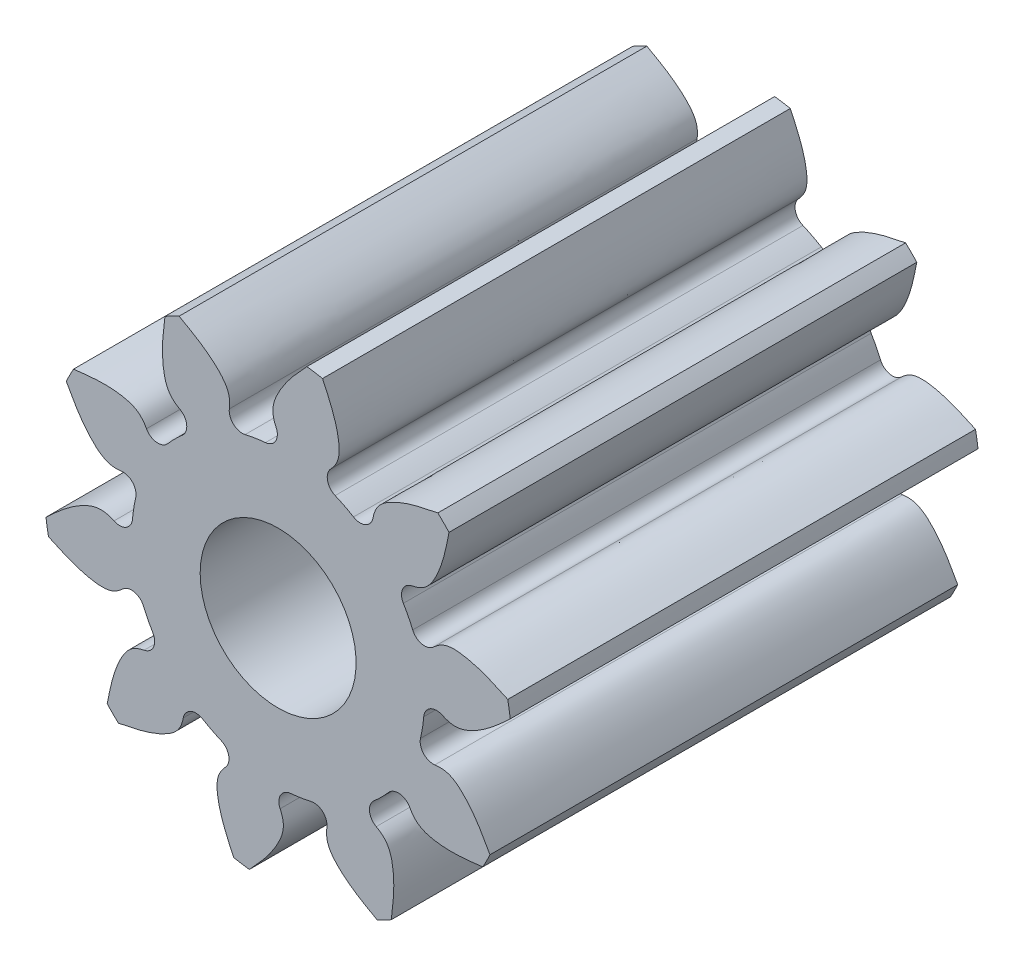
ISO-10303-21;
HEADER;
FILE_DESCRIPTION(('STEP AP214'),'2;1');
FILE_NAME('part.step','',(''),(''),'','','');
FILE_SCHEMA(('AUTOMOTIVE_DESIGN { 1 0 10303 214 1 1 1 1 }'));
ENDSEC;
DATA;
#1=APPLICATION_CONTEXT('core data for automotive mechanical design processes');
#2=APPLICATION_PROTOCOL_DEFINITION('international standard','automotive_design',2000,#1);
#3=PRODUCT_CONTEXT('',#1,'mechanical');
#4=PRODUCT('Part','Part','',(#3));
#5=PRODUCT_RELATED_PRODUCT_CATEGORY('part','',(#4));
#6=PRODUCT_DEFINITION_FORMATION('','',#4);
#7=PRODUCT_DEFINITION_CONTEXT('part definition',#1,'design');
#8=PRODUCT_DEFINITION('design','',#6,#7);
#9=PRODUCT_DEFINITION_SHAPE('','',#8);
#10=(LENGTH_UNIT() NAMED_UNIT(*) SI_UNIT(.MILLI.,.METRE.));
#11=(NAMED_UNIT(*) PLANE_ANGLE_UNIT() SI_UNIT($,.RADIAN.));
#12=(NAMED_UNIT(*) SI_UNIT($,.STERADIAN.) SOLID_ANGLE_UNIT());
#13=UNCERTAINTY_MEASURE_WITH_UNIT(LENGTH_MEASURE(1.E-05),#10,'distance_accuracy_value','');
#14=(GEOMETRIC_REPRESENTATION_CONTEXT(3) GLOBAL_UNCERTAINTY_ASSIGNED_CONTEXT((#13)) GLOBAL_UNIT_ASSIGNED_CONTEXT((#10,
#11,#12)) REPRESENTATION_CONTEXT('',''));
#15=CARTESIAN_POINT('',(0.,0.,0.));
#16=DIRECTION('',(0.,0.,1.));
#17=DIRECTION('',(1.,0.,0.));
#18=AXIS2_PLACEMENT_3D('',#15,#16,#17);
#19=CARTESIAN_POINT('',(0.,0.,6.));
#20=DIRECTION('',(0.,0.,1.));
#21=DIRECTION('',(1.,0.,0.));
#22=AXIS2_PLACEMENT_3D('',#19,#20,#21);
#23=PLANE('',#22);
#24=CARTESIAN_POINT('',(1.45157792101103,-2.62543739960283,6.));
#25=CARTESIAN_POINT('',(1.47608346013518,-2.42596774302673,6.));
#26=CARTESIAN_POINT('',(1.51053969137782,-2.14550165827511,6.));
#27=CARTESIAN_POINT('',(1.41238009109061,-1.77320545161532,6.));
#28=CARTESIAN_POINT('',(1.16883493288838,-1.62908772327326,6.));
#29=CARTESIAN_POINT('',(0.98925667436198,-1.60161829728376,6.));
#30=CARTESIAN_POINT('',(0.890158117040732,-1.58645955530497,6.));
#31=B_SPLINE_CURVE_WITH_KNOTS('',3,(#24,#25,#26,#27,#28,#29,#30),.UNSPECIFIED.,.F.,.F.,(4,1,1,1,
4),(0.,0.432503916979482,0.60812597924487,0.78374804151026,1.),.UNSPECIFIED.);
#32=CARTESIAN_POINT('',(1.45157792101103,-2.62543739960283,6.));
#33=VERTEX_POINT('',#32);
#34=CARTESIAN_POINT('',(1.25843544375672,-1.68817041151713,6.));
#35=VERTEX_POINT('',#34);
#36=EDGE_CURVE('E727',#33,#35,#31,.T.);
#37=ORIENTED_EDGE('',*,*,#36,.T.);
#38=CARTESIAN_POINT('',(1.33817157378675,-1.54189085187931,6.));
#39=DIRECTION('',(0.,0.,1.));
#40=DIRECTION('',(1.,0.,0.));
#41=AXIS2_PLACEMENT_3D('',#38,#39,#40);
#42=CIRCLE('',#41,0.1666);
#43=CARTESIAN_POINT('',(1.22897320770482,-1.41606844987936,6.));
#44=VERTEX_POINT('',#43);
#45=EDGE_CURVE('E1121',#35,#44,#42,.F.);
#46=ORIENTED_EDGE('',*,*,#45,.T.);
#47=CARTESIAN_POINT('',(0.,0.,6.));
#48=DIRECTION('',(0.,0.,1.));
#49=DIRECTION('',(1.,0.,0.));
#50=AXIS2_PLACEMENT_3D('',#47,#48,#49);
#51=CIRCLE('',#50,1.875);
#52=CARTESIAN_POINT('',(1.41587269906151,-1.22919872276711,6.));
#53=VERTEX_POINT('',#52);
#54=EDGE_CURVE('E1138',#44,#53,#51,.T.);
#55=ORIENTED_EDGE('',*,*,#54,.T.);
#56=CARTESIAN_POINT('',(1.54167770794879,-1.33841712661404,6.));
#57=DIRECTION('',(0.,0.,1.));
#58=DIRECTION('',(1.,0.,0.));
#59=AXIS2_PLACEMENT_3D('',#56,#57,#58);
#60=CIRCLE('',#59,0.1666);
#61=CARTESIAN_POINT('',(1.6879699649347,-1.25870429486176,6.));
#62=VERTEX_POINT('',#61);
#63=EDGE_CURVE('E1134',#53,#62,#60,.F.);
#64=ORIENTED_EDGE('',*,*,#63,.T.);
#65=CARTESIAN_POINT('',(1.5863177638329,-0.890410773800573,6.));
#66=CARTESIAN_POINT('',(1.6014607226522,-0.989511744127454,6.));
#67=CARTESIAN_POINT('',(1.62890154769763,-1.16909437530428,6.));
#68=CARTESIAN_POINT('',(1.772980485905,-1.41266248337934,6.));
#69=CARTESIAN_POINT('',(2.14526105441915,-1.51088137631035,6.));
#70=CARTESIAN_POINT('',(2.42573262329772,-1.47646981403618,6.));
#71=CARTESIAN_POINT('',(2.62520618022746,-1.45199604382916,6.));
#72=B_SPLINE_CURVE_WITH_KNOTS('',3,(#65,#66,#67,#68,#69,#70,#71),.UNSPECIFIED.,.F.,.F.,(4,1,1,1,
4),(0.,0.21625195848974,0.391874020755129,0.567496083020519,1.),.UNSPECIFIED.);
#73=CARTESIAN_POINT('',(2.62520618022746,-1.45199604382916,6.));
#74=VERTEX_POINT('',#73);
#75=EDGE_CURVE('E744',#62,#74,#72,.T.);
#76=ORIENTED_EDGE('',*,*,#75,.T.);
#77=CARTESIAN_POINT('',(0.,0.,6.));
#78=DIRECTION('',(0.,0.,1.));
#79=DIRECTION('',(-0.809016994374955,0.587785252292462,0.));
#80=AXIS2_PLACEMENT_3D('',#77,#78,#79);
#81=CIRCLE('',#80,3.);
#82=CARTESIAN_POINT('',(2.71754459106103,-1.2708073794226,6.));
#83=VERTEX_POINT('',#82);
#84=EDGE_CURVE('E427',#74,#83,#81,.T.);
#85=ORIENTED_EDGE('',*,*,#84,.T.);
#86=CARTESIAN_POINT('',(2.71754459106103,-1.2708073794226,6.));
#87=CARTESIAN_POINT('',(2.6201246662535,-1.09502904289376,6.));
#88=CARTESIAN_POINT('',(2.4831465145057,-0.847874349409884,6.));
#89=CARTESIAN_POINT('',(2.18490350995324,-0.604377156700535,6.));
#90=CARTESIAN_POINT('',(1.90316106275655,-0.630935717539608,6.));
#91=CARTESIAN_POINT('',(1.74173307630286,-0.714265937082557,6.));
#92=CARTESIAN_POINT('',(1.65265057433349,-0.760250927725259,6.));
#93=B_SPLINE_CURVE_WITH_KNOTS('',3,(#86,#87,#88,#89,#90,#91,#92),.UNSPECIFIED.,.F.,.F.,(4,1,1,1,
4),(0.,0.432503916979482,0.60812597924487,0.78374804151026,1.),.UNSPECIFIED.);
#94=CARTESIAN_POINT('',(2.01037733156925,-0.626068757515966,6.));
#95=VERTEX_POINT('',#94);
#96=EDGE_CURVE('E433',#83,#95,#93,.T.);
#97=ORIENTED_EDGE('',*,*,#96,.T.);
#98=CARTESIAN_POINT('',(1.98890424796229,-0.460858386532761,6.));
#99=DIRECTION('',(0.,0.,1.));
#100=DIRECTION('',(1.,0.,0.));
#101=AXIS2_PLACEMENT_3D('',#98,#99,#100);
#102=CIRCLE('',#101,0.1666);
#103=CARTESIAN_POINT('',(1.82660436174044,-0.423251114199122,6.));
#104=VERTEX_POINT('',#103);
#105=EDGE_CURVE('E36',#95,#104,#102,.F.);
#106=ORIENTED_EDGE('',*,*,#105,.T.);
#107=CARTESIAN_POINT('',(1.86796995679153,-0.1622135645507,6.));
#108=VERTEX_POINT('',#107);
#109=EDGE_CURVE('E955',#104,#108,#51,.T.);
#110=ORIENTED_EDGE('',*,*,#109,.T.);
#111=CARTESIAN_POINT('',(2.03394531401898,-0.176626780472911,6.));
#112=DIRECTION('',(0.,0.,1.));
#113=DIRECTION('',(1.,0.,0.));
#114=AXIS2_PLACEMENT_3D('',#111,#112,#113);
#115=CIRCLE('',#114,0.1666);
#116=CARTESIAN_POINT('',(2.1054442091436,-0.0261493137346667,6.));
#117=VERTEX_POINT('',#116);
#118=EDGE_CURVE('E975',#108,#117,#115,.F.);
#119=ORIENTED_EDGE('',*,*,#118,.T.);
#120=CARTESIAN_POINT('',(1.80672835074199,0.212056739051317,6.));
#121=CARTESIAN_POINT('',(1.87722935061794,0.14078317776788,6.));
#122=CARTESIAN_POINT('',(2.00498546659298,0.0116270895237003,6.));
#123=CARTESIAN_POINT('',(2.26471351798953,-0.100736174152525,6.));
#124=CARTESIAN_POINT('',(2.62362644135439,0.0386241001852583,6.));
#125=CARTESIAN_POINT('',(2.83030609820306,0.231320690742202,6.));
#126=CARTESIAN_POINT('',(2.97729827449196,0.368368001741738,6.));
#127=B_SPLINE_CURVE_WITH_KNOTS('',3,(#120,#121,#122,#123,#124,#125,#126),.UNSPECIFIED.,.F.,.F.,
(4,1,1,1,4),(0.,0.21625195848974,0.391874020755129,0.567496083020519,1.),.UNSPECIFIED.);
#128=CARTESIAN_POINT('',(2.97729827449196,0.368368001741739,6.));
#129=VERTEX_POINT('',#128);
#130=EDGE_CURVE('E696',#117,#129,#127,.T.);
#131=ORIENTED_EDGE('',*,*,#130,.T.);
#132=CARTESIAN_POINT('',(0.,0.,6.));
#133=DIRECTION('',(0.,0.,1.));
#134=DIRECTION('',(-1.,0.,0.));
#135=AXIS2_PLACEMENT_3D('',#132,#133,#134);
#136=CIRCLE('',#135,3.);
#137=CARTESIAN_POINT('',(2.94550159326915,0.569227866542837,6.));
#138=VERTEX_POINT('',#137);
#139=EDGE_CURVE('E704',#129,#138,#136,.T.);
#140=ORIENTED_EDGE('',*,*,#139,.T.);
#141=CARTESIAN_POINT('',(2.94550159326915,0.569227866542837,6.));
#142=CARTESIAN_POINT('',(2.76336730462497,0.65417353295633,6.));
#143=CARTESIAN_POINT('',(2.50727576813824,0.773612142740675,6.));
#144=CARTESIAN_POINT('',(2.12286805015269,0.795302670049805,6.));
#145=CARTESIAN_POINT('',(1.91054435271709,0.608212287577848,6.));
#146=CARTESIAN_POINT('',(1.82892664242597,0.445911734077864,6.));
#147=CARTESIAN_POINT('',(1.7838866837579,0.356347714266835,6.));
#148=B_SPLINE_CURVE_WITH_KNOTS('',3,(#141,#142,#143,#144,#145,#146,#147),.UNSPECIFIED.,.F.,.F.,
(4,1,1,1,4),(0.,0.432503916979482,0.60812597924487,0.78374804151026,1.),.UNSPECIFIED.);
#149=CARTESIAN_POINT('',(1.99442340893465,0.675169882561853,6.));
#150=VERTEX_POINT('',#149);
#151=EDGE_CURVE('E936',#138,#150,#148,.T.);
#152=ORIENTED_EDGE('',*,*,#151,.T.);
#153=CARTESIAN_POINT('',(1.87994309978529,0.796206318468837,6.));
#154=DIRECTION('',(0.,0.,1.));
#155=DIRECTION('',(1.,0.,0.));
#156=AXIS2_PLACEMENT_3D('',#153,#154,#155);
#157=CIRCLE('',#156,0.1666);
#158=CARTESIAN_POINT('',(1.72653473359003,0.731233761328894,6.));
#159=VERTEX_POINT('',#158);
#160=EDGE_CURVE('E977',#150,#159,#157,.F.);
#161=ORIENTED_EDGE('',*,*,#160,.T.);
#162=CARTESIAN_POINT('',(1.60656618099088,0.96673166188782,6.));
#163=VERTEX_POINT('',#162);
#164=EDGE_CURVE('E957',#159,#163,#51,.T.);
#165=ORIENTED_EDGE('',*,*,#164,.T.);
#166=CARTESIAN_POINT('',(1.74931494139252,1.05262899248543,6.));
#167=DIRECTION('',(0.,0.,1.));
#168=DIRECTION('',(1.,0.,0.));
#169=AXIS2_PLACEMENT_3D('',#166,#167,#168);
#170=CIRCLE('',#169,0.1666);
#171=CARTESIAN_POINT('',(1.71871032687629,1.21639381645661,6.));
#172=VERTEX_POINT('',#171);
#173=EDGE_CURVE('E993',#163,#172,#170,.F.);
#174=ORIENTED_EDGE('',*,*,#173,.T.);
#175=CARTESIAN_POINT('',(1.33703011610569,1.23352578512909,6.));
#176=CARTESIAN_POINT('',(1.43596017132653,1.21730371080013,6.));
#177=CARTESIAN_POINT('',(1.61523308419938,1.18790740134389,6.));
#178=CARTESIAN_POINT('',(1.89140296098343,1.24966792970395,6.));
#179=CARTESIAN_POINT('',(2.09985570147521,1.57337648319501,6.));
#180=CARTESIAN_POINT('',(2.15379884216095,1.85075455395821,6.));
#181=CARTESIAN_POINT('',(2.19216362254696,2.04802799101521,6.));
#182=B_SPLINE_CURVE_WITH_KNOTS('',3,(#175,#176,#177,#178,#179,#180,#181),.UNSPECIFIED.,.F.,.F.,
(4,1,1,1,4),(0.,0.21625195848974,0.391874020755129,0.567496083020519,1.),.UNSPECIFIED.);
#183=CARTESIAN_POINT('',(2.19216362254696,2.04802799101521,6.));
#184=VERTEX_POINT('',#183);
#185=EDGE_CURVE('E914',#172,#184,#182,.T.);
#186=ORIENTED_EDGE('',*,*,#185,.T.);
#187=CARTESIAN_POINT('',(0.,0.,6.));
#188=DIRECTION('',(0.,0.,1.));
#189=DIRECTION('',(-0.809016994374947,-0.587785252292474,0.));
#190=AXIS2_PLACEMENT_3D('',#187,#188,#189);
#191=CIRCLE('',#190,3.);
#192=CARTESIAN_POINT('',(2.04837710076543,2.19183741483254,6.));
#193=VERTEX_POINT('',#192);
#194=EDGE_CURVE('E672',#184,#193,#191,.T.);
#195=ORIENTED_EDGE('',*,*,#194,.T.);
#196=CARTESIAN_POINT('',(2.04837710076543,2.19183741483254,6.));
#197=CARTESIAN_POINT('',(1.8510975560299,2.15350405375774,6.));
#198=CARTESIAN_POINT('',(1.57371089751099,2.09960509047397,6.));
#199=CARTESIAN_POINT('',(1.24996914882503,1.89120390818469,6.));
#200=CARTESIAN_POINT('',(1.18816463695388,1.61504387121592,6.));
#201=CARTESIAN_POINT('',(1.21753239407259,1.43576627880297,6.));
#202=CARTESIAN_POINT('',(1.23373871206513,1.33683364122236,6.));
#203=B_SPLINE_CURVE_WITH_KNOTS('',3,(#196,#197,#198,#199,#200,#201,#202),.UNSPECIFIED.,.F.,.F.,
(4,1,1,1,4),(0.,0.432503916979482,0.60812597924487,0.78374804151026,1.),.UNSPECIFIED.);
#204=CARTESIAN_POINT('',(1.21666753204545,1.71851657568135,6.));
#205=VERTEX_POINT('',#204);
#206=EDGE_CURVE('E664',#193,#205,#203,.T.);
#207=ORIENTED_EDGE('',*,*,#206,.T.);
#208=CARTESIAN_POINT('',(1.05290758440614,1.74914727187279,6.));
#209=DIRECTION('',(0.,0.,1.));
#210=DIRECTION('',(1.,0.,0.));
#211=AXIS2_PLACEMENT_3D('',#208,#209,#210);
#212=CIRCLE('',#211,0.1666);
#213=CARTESIAN_POINT('',(0.966987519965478,1.60641219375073,6.));
#214=VERTEX_POINT('',#213);
#215=EDGE_CURVE('E995',#205,#214,#212,.F.);
#216=ORIENTED_EDGE('',*,*,#215,.T.);
#217=CARTESIAN_POINT('',(0.731508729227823,1.72641825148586,6.));
#218=VERTEX_POINT('',#217);
#219=EDGE_CURVE('E961',#214,#218,#51,.T.);
#220=ORIENTED_EDGE('',*,*,#219,.T.);
#221=CARTESIAN_POINT('',(0.796505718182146,1.87981626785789,6.));
#222=DIRECTION('',(0.,0.,1.));
#223=DIRECTION('',(1.,0.,0.));
#224=AXIS2_PLACEMENT_3D('',#221,#222,#223);
#225=CIRCLE('',#224,0.1666);
#226=CARTESIAN_POINT('',(0.675487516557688,1.99431585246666,6.));
#227=VERTEX_POINT('',#226);
#228=EDGE_CURVE('E1011',#218,#227,#225,.F.);
#229=ORIENTED_EDGE('',*,*,#228,.T.);
#230=CARTESIAN_POINT('',(0.356631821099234,1.78382990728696,6.));
#231=CARTESIAN_POINT('',(0.446203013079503,1.82885560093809,6.));
#232=CARTESIAN_POINT('',(0.608516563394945,1.91044746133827,6.));
#233=CARTESIAN_POINT('',(0.795640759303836,2.12274135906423,6.));
#234=CARTESIAN_POINT('',(0.77401145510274,2.50715252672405,6.));
#235=CARTESIAN_POINT('',(0.654613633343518,2.76326308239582,6.));
#236=CARTESIAN_POINT('',(0.569696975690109,2.94541089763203,6.));
#237=B_SPLINE_CURVE_WITH_KNOTS('',3,(#230,#231,#232,#233,#234,#235,#236),.UNSPECIFIED.,.F.,.F.,
(4,1,1,1,4),(0.,0.21625195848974,0.391874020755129,0.567496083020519,1.),.UNSPECIFIED.);
#238=CARTESIAN_POINT('',(0.569696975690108,2.94541089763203,6.));
#239=VERTEX_POINT('',#238);
#240=EDGE_CURVE('E634',#227,#239,#237,.T.);
#241=ORIENTED_EDGE('',*,*,#240,.T.);
#242=CARTESIAN_POINT('',(0.,0.,6.));
#243=DIRECTION('',(0.,0.,1.));
#244=DIRECTION('',(-0.309016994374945,-0.951056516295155,0.));
#245=AXIS2_PLACEMENT_3D('',#242,#243,#244);
#246=CIRCLE('',#245,3.);
#247=CARTESIAN_POINT('',(0.368842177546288,2.97723956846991,6.));
#248=VERTEX_POINT('',#247);
#249=EDGE_CURVE('E642',#239,#248,#246,.T.);
#250=ORIENTED_EDGE('',*,*,#249,.T.);
#251=CARTESIAN_POINT('',(0.368842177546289,2.97723956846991,6.));
#252=CARTESIAN_POINT('',(0.231771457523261,2.83026922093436,6.));
#253=CARTESIAN_POINT('',(0.0390419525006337,2.6236202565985,6.));
#254=CARTESIAN_POINT('',(-0.10037548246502,2.26472953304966,6.));
#255=CARTESIAN_POINT('',(0.0119464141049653,2.00498358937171,6.));
#256=CARTESIAN_POINT('',(0.141082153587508,1.8772069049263,6.));
#257=CARTESIAN_POINT('',(0.212344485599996,1.80669455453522,6.));
#258=B_SPLINE_CURVE_WITH_KNOTS('',3,(#251,#252,#253,#254,#255,#256,#257),.UNSPECIFIED.,.F.,.F.,
(4,1,1,1,4),(0.,0.432503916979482,0.60812597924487,0.78374804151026,1.),.UNSPECIFIED.);
#259=CARTESIAN_POINT('',(-0.0258139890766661,2.10544834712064,6.));
#260=VERTEX_POINT('',#259);
#261=EDGE_CURVE('E886',#248,#260,#258,.T.);
#262=ORIENTED_EDGE('',*,*,#261,.T.);
#263=CARTESIAN_POINT('',(-0.176302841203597,2.03397341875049,6.));
#264=DIRECTION('',(0.,0.,1.));
#265=DIRECTION('',(1.,0.,0.));
#266=AXIS2_PLACEMENT_3D('',#263,#264,#265);
#267=CIRCLE('',#266,0.1666);
#268=CARTESIAN_POINT('',(-0.161916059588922,1.86799576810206,6.));
#269=VERTEX_POINT('',#268);
#270=EDGE_CURVE('E1013',#260,#269,#267,.F.);
#271=ORIENTED_EDGE('',*,*,#270,.T.);
#272=CARTESIAN_POINT('',(-0.422960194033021,1.82667174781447,6.));
#273=VERTEX_POINT('',#272);
#274=EDGE_CURVE('E1196',#269,#273,#51,.T.);
#275=ORIENTED_EDGE('',*,*,#274,.T.);
#276=CARTESIAN_POINT('',(-0.460541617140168,1.98897762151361,6.));
#277=DIRECTION('',(0.,0.,1.));
#278=DIRECTION('',(1.,0.,0.));
#279=AXIS2_PLACEMENT_3D('',#276,#277,#278);
#280=CIRCLE('',#279,0.1666);
#281=CARTESIAN_POINT('',(-0.625748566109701,2.01047701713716,6.));
#282=VERTEX_POINT('',#281);
#283=EDGE_CURVE('E1029',#273,#282,#280,.F.);
#284=ORIENTED_EDGE('',*,*,#283,.T.);
#285=CARTESIAN_POINT('',(-0.759987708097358,1.65277163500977,6.));
#286=CARTESIAN_POINT('',(-0.713988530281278,1.74184681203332,6.));
#287=CARTESIAN_POINT('',(-0.630632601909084,1.90326152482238,6.));
#288=CARTESIAN_POINT('',(-0.604029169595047,2.18499973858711,6.));
#289=CARTESIAN_POINT('',(-0.847478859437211,2.48328152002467,6.));
#290=CARTESIAN_POINT('',(-1.09461173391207,2.62029903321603,6.));
#291=CARTESIAN_POINT('',(-1.27037455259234,2.71774695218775,6.));
#292=B_SPLINE_CURVE_WITH_KNOTS('',3,(#285,#286,#287,#288,#289,#290,#291),.UNSPECIFIED.,.F.,.F.,
(4,1,1,1,4),(0.,0.21625195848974,0.391874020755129,0.567496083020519,1.),.UNSPECIFIED.);
#293=CARTESIAN_POINT('',(-1.27037455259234,2.71774695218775,6.));
#294=VERTEX_POINT('',#293);
#295=EDGE_CURVE('E872',#282,#294,#292,.T.);
#296=ORIENTED_EDGE('',*,*,#295,.T.);
#297=CARTESIAN_POINT('',(0.,0.,6.));
#298=DIRECTION('',(0.,0.,1.));
#299=DIRECTION('',(0.309016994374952,-0.951056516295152,0.));
#300=AXIS2_PLACEMENT_3D('',#297,#298,#299);
#301=CIRCLE('',#300,3.);
#302=CARTESIAN_POINT('',(-1.45157792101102,2.62543739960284,6.));
#303=VERTEX_POINT('',#302);
#304=EDGE_CURVE('E610',#294,#303,#301,.T.);
#305=ORIENTED_EDGE('',*,*,#304,.T.);
#306=CARTESIAN_POINT('',(-1.45157792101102,2.62543739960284,6.));
#307=CARTESIAN_POINT('',(-1.47608346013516,2.42596774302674,6.));
#308=CARTESIAN_POINT('',(-1.5105396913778,2.14550165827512,6.));
#309=CARTESIAN_POINT('',(-1.4123800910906,1.77320545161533,6.));
#310=CARTESIAN_POINT('',(-1.16883493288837,1.62908772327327,6.));
#311=CARTESIAN_POINT('',(-0.989256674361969,1.60161829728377,6.));
#312=CARTESIAN_POINT('',(-0.890158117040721,1.58645955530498,6.));
#313=B_SPLINE_CURVE_WITH_KNOTS('',3,(#306,#307,#308,#309,#310,#311,#312),.UNSPECIFIED.,.F.,.F.,
(4,1,1,1,4),(0.,0.432503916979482,0.60812597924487,0.78374804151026,1.),.UNSPECIFIED.);
#314=CARTESIAN_POINT('',(-1.25843544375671,1.68817041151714,6.));
#315=VERTEX_POINT('',#314);
#316=EDGE_CURVE('E602',#303,#315,#313,.T.);
#317=ORIENTED_EDGE('',*,*,#316,.T.);
#318=CARTESIAN_POINT('',(-1.33817157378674,1.54189085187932,6.));
#319=DIRECTION('',(0.,0.,1.));
#320=DIRECTION('',(1.,0.,0.));
#321=AXIS2_PLACEMENT_3D('',#318,#319,#320);
#322=CIRCLE('',#321,0.1666);
#323=CARTESIAN_POINT('',(-1.22897320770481,1.41606844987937,6.));
#324=VERTEX_POINT('',#323);
#325=EDGE_CURVE('E1031',#315,#324,#322,.F.);
#326=ORIENTED_EDGE('',*,*,#325,.T.);
#327=CARTESIAN_POINT('',(-1.4158726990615,1.22919872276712,6.));
#328=VERTEX_POINT('',#327);
#329=EDGE_CURVE('E1276',#324,#328,#51,.T.);
#330=ORIENTED_EDGE('',*,*,#329,.T.);
#331=CARTESIAN_POINT('',(-1.54167770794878,1.33841712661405,6.));
#332=DIRECTION('',(0.,0.,1.));
#333=DIRECTION('',(1.,0.,0.));
#334=AXIS2_PLACEMENT_3D('',#331,#332,#333);
#335=CIRCLE('',#334,0.1666);
#336=CARTESIAN_POINT('',(-1.68796996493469,1.25870429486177,6.));
#337=VERTEX_POINT('',#336);
#338=EDGE_CURVE('E1047',#328,#337,#335,.F.);
#339=ORIENTED_EDGE('',*,*,#338,.T.);
#340=CARTESIAN_POINT('',(-1.58631776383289,0.890410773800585,6.));
#341=CARTESIAN_POINT('',(-1.60146072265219,0.989511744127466,6.));
#342=CARTESIAN_POINT('',(-1.62890154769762,1.16909437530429,6.));
#343=CARTESIAN_POINT('',(-1.77298048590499,1.41266248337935,6.));
#344=CARTESIAN_POINT('',(-2.14526105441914,1.51088137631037,6.));
#345=CARTESIAN_POINT('',(-2.4257326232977,1.4764698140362,6.));
#346=CARTESIAN_POINT('',(-2.62520618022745,1.45199604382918,6.));
#347=B_SPLINE_CURVE_WITH_KNOTS('',3,(#340,#341,#342,#343,#344,#345,#346),.UNSPECIFIED.,.F.,.F.,
(4,1,1,1,4),(0.,0.21625195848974,0.391874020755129,0.567496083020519,1.),.UNSPECIFIED.);
#348=CARTESIAN_POINT('',(-2.62520618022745,1.45199604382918,6.));
#349=VERTEX_POINT('',#348);
#350=EDGE_CURVE('E572',#337,#349,#347,.T.);
#351=ORIENTED_EDGE('',*,*,#350,.T.);
#352=CARTESIAN_POINT('',(0.,0.,6.));
#353=DIRECTION('',(0.,0.,1.));
#354=DIRECTION('',(0.809016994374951,-0.587785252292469,0.));
#355=AXIS2_PLACEMENT_3D('',#352,#353,#354);
#356=CIRCLE('',#355,3.);
#357=CARTESIAN_POINT('',(-2.71754459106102,1.27080737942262,6.));
#358=VERTEX_POINT('',#357);
#359=EDGE_CURVE('E580',#349,#358,#356,.T.);
#360=ORIENTED_EDGE('',*,*,#359,.T.);
#361=CARTESIAN_POINT('',(-2.71754459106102,1.27080737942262,6.));
#362=CARTESIAN_POINT('',(-2.6201246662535,1.09502904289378,6.));
#363=CARTESIAN_POINT('',(-2.48314651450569,0.847874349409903,6.));
#364=CARTESIAN_POINT('',(-2.18490350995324,0.604377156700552,6.));
#365=CARTESIAN_POINT('',(-1.90316106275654,0.630935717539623,6.));
#366=CARTESIAN_POINT('',(-1.74173307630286,0.71426593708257,6.));
#367=CARTESIAN_POINT('',(-1.65265057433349,0.760250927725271,6.));
#368=B_SPLINE_CURVE_WITH_KNOTS('',3,(#361,#362,#363,#364,#365,#366,#367),.UNSPECIFIED.,.F.,.F.,
(4,1,1,1,4),(0.,0.432503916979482,0.60812597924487,0.78374804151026,1.),.UNSPECIFIED.);
#369=CARTESIAN_POINT('',(-2.01037733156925,0.626068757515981,6.));
#370=VERTEX_POINT('',#369);
#371=EDGE_CURVE('E844',#358,#370,#368,.T.);
#372=ORIENTED_EDGE('',*,*,#371,.T.);
#373=CARTESIAN_POINT('',(-1.98890424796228,0.460858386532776,6.));
#374=DIRECTION('',(0.,0.,1.));
#375=DIRECTION('',(1.,0.,0.));
#376=AXIS2_PLACEMENT_3D('',#373,#374,#375);
#377=CIRCLE('',#376,0.1666);
#378=CARTESIAN_POINT('',(-1.82660436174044,0.423251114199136,6.));
#379=VERTEX_POINT('',#378);
#380=EDGE_CURVE('E1049',#370,#379,#377,.F.);
#381=ORIENTED_EDGE('',*,*,#380,.T.);
#382=CARTESIAN_POINT('',(-1.86796995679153,0.162213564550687,6.));
#383=VERTEX_POINT('',#382);
#384=EDGE_CURVE('E1272',#379,#383,#51,.T.);
#385=ORIENTED_EDGE('',*,*,#384,.T.);
#386=CARTESIAN_POINT('',(-2.03394531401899,0.176626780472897,6.));
#387=DIRECTION('',(0.,0.,1.));
#388=DIRECTION('',(1.,0.,0.));
#389=AXIS2_PLACEMENT_3D('',#386,#387,#388);
#390=CIRCLE('',#389,0.1666);
#391=CARTESIAN_POINT('',(-2.1054442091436,0.0261493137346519,6.));
#392=VERTEX_POINT('',#391);
#393=EDGE_CURVE('E1065',#383,#392,#390,.F.);
#394=ORIENTED_EDGE('',*,*,#393,.T.);
#395=CARTESIAN_POINT('',(-1.80672835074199,-0.21205673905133,6.));
#396=CARTESIAN_POINT('',(-1.87722935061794,-0.140783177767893,6.));
#397=CARTESIAN_POINT('',(-2.00498546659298,-0.0116270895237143,6.));
#398=CARTESIAN_POINT('',(-2.26471351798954,0.100736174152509,6.));
#399=CARTESIAN_POINT('',(-2.62362644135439,-0.0386241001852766,6.));
#400=CARTESIAN_POINT('',(-2.83030609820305,-0.231320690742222,6.));
#401=CARTESIAN_POINT('',(-2.97729827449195,-0.368368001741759,6.));
#402=B_SPLINE_CURVE_WITH_KNOTS('',3,(#395,#396,#397,#398,#399,#400,#401),.UNSPECIFIED.,.F.,.F.,
(4,1,1,1,4),(0.,0.21625195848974,0.391874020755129,0.567496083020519,1.),.UNSPECIFIED.);
#403=CARTESIAN_POINT('',(-2.97729827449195,-0.36836800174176,6.));
#404=VERTEX_POINT('',#403);
#405=EDGE_CURVE('E830',#392,#404,#402,.T.);
#406=ORIENTED_EDGE('',*,*,#405,.T.);
#407=CARTESIAN_POINT('',(0.,0.,6.));
#408=DIRECTION('',(0.,0.,1.));
#409=DIRECTION('',(1.,0.,0.));
#410=AXIS2_PLACEMENT_3D('',#407,#408,#409);
#411=CIRCLE('',#410,3.);
#412=CARTESIAN_POINT('',(-2.94550159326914,-0.569227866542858,6.));
#413=VERTEX_POINT('',#412);
#414=EDGE_CURVE('E548',#404,#413,#411,.T.);
#415=ORIENTED_EDGE('',*,*,#414,.T.);
#416=CARTESIAN_POINT('',(-2.94550159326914,-0.569227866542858,6.));
#417=CARTESIAN_POINT('',(-2.76336730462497,-0.654173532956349,6.));
#418=CARTESIAN_POINT('',(-2.50727576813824,-0.773612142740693,6.));
#419=CARTESIAN_POINT('',(-2.12286805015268,-0.79530267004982,6.));
#420=CARTESIAN_POINT('',(-1.91054435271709,-0.608212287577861,6.));
#421=CARTESIAN_POINT('',(-1.82892664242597,-0.445911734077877,6.));
#422=CARTESIAN_POINT('',(-1.78388668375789,-0.356347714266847,6.));
#423=B_SPLINE_CURVE_WITH_KNOTS('',3,(#416,#417,#418,#419,#420,#421,#422),.UNSPECIFIED.,.F.,.F.,
(4,1,1,1,4),(0.,0.432503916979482,0.60812597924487,0.78374804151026,1.),.UNSPECIFIED.);
#424=CARTESIAN_POINT('',(-1.99442340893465,-0.675169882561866,6.));
#425=VERTEX_POINT('',#424);
#426=EDGE_CURVE('E540',#413,#425,#423,.T.);
#427=ORIENTED_EDGE('',*,*,#426,.T.);
#428=CARTESIAN_POINT('',(-1.87994309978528,-0.79620631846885,6.));
#429=DIRECTION('',(0.,0.,1.));
#430=DIRECTION('',(1.,0.,0.));
#431=AXIS2_PLACEMENT_3D('',#428,#429,#430);
#432=CIRCLE('',#431,0.1666);
#433=CARTESIAN_POINT('',(-1.72653473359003,-0.731233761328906,6.));
#434=VERTEX_POINT('',#433);
#435=EDGE_CURVE('E1067',#425,#434,#432,.F.);
#436=ORIENTED_EDGE('',*,*,#435,.T.);
#437=CARTESIAN_POINT('',(-1.60656618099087,-0.966731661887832,6.));
#438=VERTEX_POINT('',#437);
#439=EDGE_CURVE('E1270',#434,#438,#51,.T.);
#440=ORIENTED_EDGE('',*,*,#439,.T.);
#441=CARTESIAN_POINT('',(-1.74931494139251,-1.05262899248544,6.));
#442=DIRECTION('',(0.,0.,1.));
#443=DIRECTION('',(1.,0.,0.));
#444=AXIS2_PLACEMENT_3D('',#441,#442,#443);
#445=CIRCLE('',#444,0.1666);
#446=CARTESIAN_POINT('',(-1.71871032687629,-1.21639381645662,6.));
#447=VERTEX_POINT('',#446);
#448=EDGE_CURVE('E1083',#438,#447,#445,.F.);
#449=ORIENTED_EDGE('',*,*,#448,.T.);
#450=CARTESIAN_POINT('',(-1.33703011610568,-1.2335257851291,6.));
#451=CARTESIAN_POINT('',(-1.43596017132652,-1.21730371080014,6.));
#452=CARTESIAN_POINT('',(-1.61523308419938,-1.1879074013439,6.));
#453=CARTESIAN_POINT('',(-1.89140296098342,-1.24966792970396,6.));
#454=CARTESIAN_POINT('',(-2.09985570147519,-1.57337648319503,6.));
#455=CARTESIAN_POINT('',(-2.15379884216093,-1.85075455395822,6.));
#456=CARTESIAN_POINT('',(-2.19216362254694,-2.04802799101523,6.));
#457=B_SPLINE_CURVE_WITH_KNOTS('',3,(#450,#451,#452,#453,#454,#455,#456),.UNSPECIFIED.,.F.,.F.,
(4,1,1,1,4),(0.,0.21625195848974,0.391874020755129,0.567496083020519,1.),.UNSPECIFIED.);
#458=CARTESIAN_POINT('',(-2.19216362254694,-2.04802799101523,6.));
#459=VERTEX_POINT('',#458);
#460=EDGE_CURVE('E510',#447,#459,#457,.T.);
#461=ORIENTED_EDGE('',*,*,#460,.T.);
#462=CARTESIAN_POINT('',(0.,0.,6.));
#463=DIRECTION('',(0.,0.,1.));
#464=DIRECTION('',(0.809016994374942,0.58778525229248,0.));
#465=AXIS2_PLACEMENT_3D('',#462,#463,#464);
#466=CIRCLE('',#465,3.);
#467=CARTESIAN_POINT('',(-2.04837710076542,-2.19183741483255,6.));
#468=VERTEX_POINT('',#467);
#469=EDGE_CURVE('E518',#459,#468,#466,.T.);
#470=ORIENTED_EDGE('',*,*,#469,.T.);
#471=CARTESIAN_POINT('',(-2.04837710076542,-2.19183741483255,6.));
#472=CARTESIAN_POINT('',(-1.85109755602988,-2.15350405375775,6.));
#473=CARTESIAN_POINT('',(-1.57371089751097,-2.09960509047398,6.));
#474=CARTESIAN_POINT('',(-1.24996914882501,-1.8912039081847,6.));
#475=CARTESIAN_POINT('',(-1.18816463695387,-1.61504387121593,6.));
#476=CARTESIAN_POINT('',(-1.21753239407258,-1.43576627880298,6.));
#477=CARTESIAN_POINT('',(-1.23373871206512,-1.33683364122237,6.));
#478=B_SPLINE_CURVE_WITH_KNOTS('',3,(#471,#472,#473,#474,#475,#476,#477),.UNSPECIFIED.,.F.,.F.,
(4,1,1,1,4),(0.,0.432503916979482,0.60812597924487,0.78374804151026,1.),.UNSPECIFIED.);
#479=CARTESIAN_POINT('',(-1.21666753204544,-1.71851657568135,6.));
#480=VERTEX_POINT('',#479);
#481=EDGE_CURVE('E802',#468,#480,#478,.T.);
#482=ORIENTED_EDGE('',*,*,#481,.T.);
#483=CARTESIAN_POINT('',(-1.05290758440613,-1.7491472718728,6.));
#484=DIRECTION('',(0.,0.,1.));
#485=DIRECTION('',(1.,0.,0.));
#486=AXIS2_PLACEMENT_3D('',#483,#484,#485);
#487=CIRCLE('',#486,0.1666);
#488=CARTESIAN_POINT('',(-0.966987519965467,-1.60641219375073,6.));
#489=VERTEX_POINT('',#488);
#490=EDGE_CURVE('E1085',#480,#489,#487,.F.);
#491=ORIENTED_EDGE('',*,*,#490,.T.);
#492=CARTESIAN_POINT('',(-0.731508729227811,-1.72641825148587,6.));
#493=VERTEX_POINT('',#492);
#494=EDGE_CURVE('E1235',#489,#493,#51,.T.);
#495=ORIENTED_EDGE('',*,*,#494,.T.);
#496=CARTESIAN_POINT('',(-0.796505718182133,-1.87981626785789,6.));
#497=DIRECTION('',(0.,0.,1.));
#498=DIRECTION('',(1.,0.,0.));
#499=AXIS2_PLACEMENT_3D('',#496,#497,#498);
#500=CIRCLE('',#499,0.1666);
#501=CARTESIAN_POINT('',(-0.675487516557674,-1.99431585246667,6.));
#502=VERTEX_POINT('',#501);
#503=EDGE_CURVE('E1101',#493,#502,#500,.F.);
#504=ORIENTED_EDGE('',*,*,#503,.T.);
#505=CARTESIAN_POINT('',(-0.356631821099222,-1.78382990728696,6.));
#506=CARTESIAN_POINT('',(-0.44620301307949,-1.8288556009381,6.));
#507=CARTESIAN_POINT('',(-0.608516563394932,-1.91044746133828,6.));
#508=CARTESIAN_POINT('',(-0.795640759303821,-2.12274135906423,6.));
#509=CARTESIAN_POINT('',(-0.774011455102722,-2.50715252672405,6.));
#510=CARTESIAN_POINT('',(-0.6546136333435,-2.76326308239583,6.));
#511=CARTESIAN_POINT('',(-0.569696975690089,-2.94541089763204,6.));
#512=B_SPLINE_CURVE_WITH_KNOTS('',3,(#505,#506,#507,#508,#509,#510,#511),.UNSPECIFIED.,.F.,.F.,
(4,1,1,1,4),(0.,0.21625195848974,0.391874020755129,0.567496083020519,1.),.UNSPECIFIED.);
#513=CARTESIAN_POINT('',(-0.569696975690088,-2.94541089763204,6.));
#514=VERTEX_POINT('',#513);
#515=EDGE_CURVE('E788',#502,#514,#512,.T.);
#516=ORIENTED_EDGE('',*,*,#515,.T.);
#517=CARTESIAN_POINT('',(0.,0.,6.));
#518=DIRECTION('',(0.,0.,1.));
#519=DIRECTION('',(0.309016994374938,0.951056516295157,0.));
#520=AXIS2_PLACEMENT_3D('',#517,#518,#519);
#521=CIRCLE('',#520,3.);
#522=CARTESIAN_POINT('',(-0.368842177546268,-2.97723956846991,6.));
#523=VERTEX_POINT('',#522);
#524=EDGE_CURVE('E486',#514,#523,#521,.T.);
#525=ORIENTED_EDGE('',*,*,#524,.T.);
#526=CARTESIAN_POINT('',(-0.368842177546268,-2.97723956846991,6.));
#527=CARTESIAN_POINT('',(-0.231771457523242,-2.83026922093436,6.));
#528=CARTESIAN_POINT('',(-0.0390419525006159,-2.6236202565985,6.));
#529=CARTESIAN_POINT('',(0.100375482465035,-2.26472953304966,6.));
#530=CARTESIAN_POINT('',(-0.0119464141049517,-2.00498358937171,6.));
#531=CARTESIAN_POINT('',(-0.141082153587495,-1.8772069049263,6.));
#532=CARTESIAN_POINT('',(-0.212344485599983,-1.80669455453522,6.));
#533=B_SPLINE_CURVE_WITH_KNOTS('',3,(#526,#527,#528,#529,#530,#531,#532),.UNSPECIFIED.,.F.,.F.,
(4,1,1,1,4),(0.,0.432503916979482,0.60812597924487,0.78374804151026,1.),.UNSPECIFIED.);
#534=CARTESIAN_POINT('',(0.0258139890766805,-2.10544834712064,6.));
#535=VERTEX_POINT('',#534);
#536=EDGE_CURVE('E478',#523,#535,#533,.T.);
#537=ORIENTED_EDGE('',*,*,#536,.T.);
#538=CARTESIAN_POINT('',(0.176302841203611,-2.03397341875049,6.));
#539=DIRECTION('',(0.,0.,1.));
#540=DIRECTION('',(1.,0.,0.));
#541=AXIS2_PLACEMENT_3D('',#538,#539,#540);
#542=CIRCLE('',#541,0.1666);
#543=CARTESIAN_POINT('',(0.161916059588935,-1.86799576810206,6.));
#544=VERTEX_POINT('',#543);
#545=EDGE_CURVE('E1103',#535,#544,#542,.F.);
#546=ORIENTED_EDGE('',*,*,#545,.T.);
#547=CARTESIAN_POINT('',(0.422960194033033,-1.82667174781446,6.));
#548=VERTEX_POINT('',#547);
#549=EDGE_CURVE('E1254',#544,#548,#51,.T.);
#550=ORIENTED_EDGE('',*,*,#549,.T.);
#551=CARTESIAN_POINT('',(0.460541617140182,-1.9889776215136,6.));
#552=DIRECTION('',(0.,0.,1.));
#553=DIRECTION('',(1.,0.,0.));
#554=AXIS2_PLACEMENT_3D('',#551,#552,#553);
#555=CIRCLE('',#554,0.1666);
#556=CARTESIAN_POINT('',(0.625748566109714,-2.01047701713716,6.));
#557=VERTEX_POINT('',#556);
#558=EDGE_CURVE('E1119',#548,#557,#555,.F.);
#559=ORIENTED_EDGE('',*,*,#558,.T.);
#560=CARTESIAN_POINT('',(0.75998770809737,-1.65277163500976,6.));
#561=CARTESIAN_POINT('',(0.71398853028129,-1.74184681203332,6.));
#562=CARTESIAN_POINT('',(0.630632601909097,-1.90326152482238,6.));
#563=CARTESIAN_POINT('',(0.604029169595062,-2.18499973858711,6.));
#564=CARTESIAN_POINT('',(0.847478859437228,-2.48328152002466,6.));
#565=CARTESIAN_POINT('',(1.09461173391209,-2.62029903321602,6.));
#566=CARTESIAN_POINT('',(1.27037455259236,-2.71774695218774,6.));
#567=B_SPLINE_CURVE_WITH_KNOTS('',3,(#560,#561,#562,#563,#564,#565,#566),.UNSPECIFIED.,.F.,.F.,
(4,1,1,1,4),(0.,0.21625195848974,0.391874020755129,0.567496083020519,1.),.UNSPECIFIED.);
#568=CARTESIAN_POINT('',(1.27037455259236,-2.71774695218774,6.));
#569=VERTEX_POINT('',#568);
#570=EDGE_CURVE('E448',#557,#569,#567,.T.);
#571=ORIENTED_EDGE('',*,*,#570,.T.);
#572=CARTESIAN_POINT('',(0.,0.,6.));
#573=DIRECTION('',(0.,0.,1.));
#574=DIRECTION('',(-0.309016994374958,0.95105651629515,0.));
#575=AXIS2_PLACEMENT_3D('',#572,#573,#574);
#576=CIRCLE('',#575,3.);
#577=EDGE_CURVE('E456',#569,#33,#576,.T.);
#578=ORIENTED_EDGE('',*,*,#577,.T.);
#579=EDGE_LOOP('',(#37,#46,#55,#64,#76,#85,#97,#106,#110,#119,#131,#140,#152,#161,#165,#174,
#186,#195,#207,#216,#220,#229,#241,#250,#262,#271,#275,#284,#296,#305,#317,#326,#330,#339,#351,
#360,#372,#381,#385,#394,#406,#415,#427,#436,#440,#449,#461,#470,#482,#491,#495,#504,#516,#525,
#537,#546,#550,#559,#571,#578));
#580=FACE_BOUND('',#579,.T.);
#581=CARTESIAN_POINT('',(0.,0.,6.));
#582=DIRECTION('',(0.,0.,1.));
#583=DIRECTION('',(1.,0.,0.));
#584=AXIS2_PLACEMENT_3D('',#581,#582,#583);
#585=CIRCLE('',#584,1.);
#586=CARTESIAN_POINT('',(-1.,0.,6.));
#587=VERTEX_POINT('',#586);
#588=EDGE_CURVE('E414',#587,#587,#585,.T.);
#589=ORIENTED_EDGE('',*,*,#588,.F.);
#590=EDGE_LOOP('',(#589));
#591=FACE_BOUND('',#590,.T.);
#592=ADVANCED_FACE('F28',(#580,#591),#23,.T.);
#593=CARTESIAN_POINT('',(0.,0.,0.));
#594=DIRECTION('',(0.,0.,1.));
#595=DIRECTION('',(1.,0.,0.));
#596=AXIS2_PLACEMENT_3D('',#593,#594,#595);
#597=PLANE('',#596);
#598=CARTESIAN_POINT('',(0.,0.,0.));
#599=DIRECTION('',(0.,0.,1.));
#600=DIRECTION('',(1.,0.,0.));
#601=AXIS2_PLACEMENT_3D('',#598,#599,#600);
#602=CIRCLE('',#601,1.875);
#603=CARTESIAN_POINT('',(1.82660436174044,-0.423251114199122,0.));
#604=VERTEX_POINT('',#603);
#605=CARTESIAN_POINT('',(1.86796995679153,-0.1622135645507,0.));
#606=VERTEX_POINT('',#605);
#607=EDGE_CURVE('E951',#604,#606,#602,.T.);
#608=ORIENTED_EDGE('',*,*,#607,.F.);
#609=CARTESIAN_POINT('',(1.98890424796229,-0.460858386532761,0.));
#610=DIRECTION('',(0.,0.,1.));
#611=DIRECTION('',(1.,0.,0.));
#612=AXIS2_PLACEMENT_3D('',#609,#610,#611);
#613=CIRCLE('',#612,0.1666);
#614=CARTESIAN_POINT('',(2.01037733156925,-0.626068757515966,0.));
#615=VERTEX_POINT('',#614);
#616=EDGE_CURVE('E11',#604,#615,#613,.T.);
#617=ORIENTED_EDGE('',*,*,#616,.T.);
#618=CARTESIAN_POINT('',(2.71754459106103,-1.2708073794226,0.));
#619=CARTESIAN_POINT('',(2.6201246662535,-1.09502904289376,0.));
#620=CARTESIAN_POINT('',(2.4831465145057,-0.847874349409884,0.));
#621=CARTESIAN_POINT('',(2.18490350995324,-0.604377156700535,0.));
#622=CARTESIAN_POINT('',(1.90316106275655,-0.630935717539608,0.));
#623=CARTESIAN_POINT('',(1.74173307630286,-0.714265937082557,0.));
#624=CARTESIAN_POINT('',(1.65265057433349,-0.760250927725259,0.));
#625=B_SPLINE_CURVE_WITH_KNOTS('',3,(#618,#619,#620,#621,#622,#623,#624),.UNSPECIFIED.,.F.,.F.,
(4,1,1,1,4),(0.,0.432503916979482,0.60812597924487,0.78374804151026,1.),.UNSPECIFIED.);
#626=CARTESIAN_POINT('',(2.71754459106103,-1.2708073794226,0.));
#627=VERTEX_POINT('',#626);
#628=EDGE_CURVE('E420',#627,#615,#625,.T.);
#629=ORIENTED_EDGE('',*,*,#628,.F.);
#630=CARTESIAN_POINT('',(0.,0.,0.));
#631=DIRECTION('',(0.,0.,1.));
#632=DIRECTION('',(-0.809016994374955,0.587785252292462,0.));
#633=AXIS2_PLACEMENT_3D('',#630,#631,#632);
#634=CIRCLE('',#633,3.);
#635=CARTESIAN_POINT('',(2.62520618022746,-1.45199604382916,0.));
#636=VERTEX_POINT('',#635);
#637=EDGE_CURVE('E413',#636,#627,#634,.T.);
#638=ORIENTED_EDGE('',*,*,#637,.F.);
#639=CARTESIAN_POINT('',(1.5863177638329,-0.890410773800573,0.));
#640=CARTESIAN_POINT('',(1.6014607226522,-0.989511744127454,0.));
#641=CARTESIAN_POINT('',(1.62890154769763,-1.16909437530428,0.));
#642=CARTESIAN_POINT('',(1.772980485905,-1.41266248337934,0.));
#643=CARTESIAN_POINT('',(2.14526105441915,-1.51088137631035,0.));
#644=CARTESIAN_POINT('',(2.42573262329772,-1.47646981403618,0.));
#645=CARTESIAN_POINT('',(2.62520618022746,-1.45199604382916,0.));
#646=B_SPLINE_CURVE_WITH_KNOTS('',3,(#639,#640,#641,#642,#643,#644,#645),.UNSPECIFIED.,.F.,.F.,
(4,1,1,1,4),(0.,0.21625195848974,0.391874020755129,0.567496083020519,1.),.UNSPECIFIED.);
#647=CARTESIAN_POINT('',(1.6879699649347,-1.25870429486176,0.));
#648=VERTEX_POINT('',#647);
#649=EDGE_CURVE('E404',#648,#636,#646,.T.);
#650=ORIENTED_EDGE('',*,*,#649,.F.);
#651=CARTESIAN_POINT('',(1.54167770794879,-1.33841712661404,0.));
#652=DIRECTION('',(0.,0.,1.));
#653=DIRECTION('',(1.,0.,0.));
#654=AXIS2_PLACEMENT_3D('',#651,#652,#653);
#655=CIRCLE('',#654,0.1666);
#656=CARTESIAN_POINT('',(1.41587269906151,-1.22919872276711,0.));
#657=VERTEX_POINT('',#656);
#658=EDGE_CURVE('E1132',#648,#657,#655,.T.);
#659=ORIENTED_EDGE('',*,*,#658,.T.);
#660=CARTESIAN_POINT('',(1.22897320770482,-1.41606844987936,0.));
#661=VERTEX_POINT('',#660);
#662=EDGE_CURVE('E1144',#661,#657,#602,.T.);
#663=ORIENTED_EDGE('',*,*,#662,.F.);
#664=CARTESIAN_POINT('',(1.33817157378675,-1.54189085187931,0.));
#665=DIRECTION('',(0.,0.,1.));
#666=DIRECTION('',(1.,0.,0.));
#667=AXIS2_PLACEMENT_3D('',#664,#665,#666);
#668=CIRCLE('',#667,0.1666);
#669=CARTESIAN_POINT('',(1.25843544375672,-1.68817041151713,0.));
#670=VERTEX_POINT('',#669);
#671=EDGE_CURVE('E1123',#661,#670,#668,.T.);
#672=ORIENTED_EDGE('',*,*,#671,.T.);
#673=CARTESIAN_POINT('',(1.45157792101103,-2.62543739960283,0.));
#674=CARTESIAN_POINT('',(1.47608346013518,-2.42596774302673,0.));
#675=CARTESIAN_POINT('',(1.51053969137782,-2.14550165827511,0.));
#676=CARTESIAN_POINT('',(1.41238009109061,-1.77320545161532,0.));
#677=CARTESIAN_POINT('',(1.16883493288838,-1.62908772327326,0.));
#678=CARTESIAN_POINT('',(0.98925667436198,-1.60161829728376,0.));
#679=CARTESIAN_POINT('',(0.890158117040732,-1.58645955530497,0.));
#680=B_SPLINE_CURVE_WITH_KNOTS('',3,(#673,#674,#675,#676,#677,#678,#679),.UNSPECIFIED.,.F.,.F.,
(4,1,1,1,4),(0.,0.432503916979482,0.60812597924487,0.78374804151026,1.),.UNSPECIFIED.);
#681=CARTESIAN_POINT('',(1.45157792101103,-2.62543739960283,0.));
#682=VERTEX_POINT('',#681);
#683=EDGE_CURVE('E443',#682,#670,#680,.T.);
#684=ORIENTED_EDGE('',*,*,#683,.F.);
#685=CARTESIAN_POINT('',(0.,0.,0.));
#686=DIRECTION('',(0.,0.,1.));
#687=DIRECTION('',(-0.309016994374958,0.95105651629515,0.));
#688=AXIS2_PLACEMENT_3D('',#685,#686,#687);
#689=CIRCLE('',#688,3.);
#690=CARTESIAN_POINT('',(1.27037455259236,-2.71774695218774,0.));
#691=VERTEX_POINT('',#690);
#692=EDGE_CURVE('E431',#691,#682,#689,.T.);
#693=ORIENTED_EDGE('',*,*,#692,.F.);
#694=CARTESIAN_POINT('',(0.75998770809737,-1.65277163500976,0.));
#695=CARTESIAN_POINT('',(0.71398853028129,-1.74184681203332,0.));
#696=CARTESIAN_POINT('',(0.630632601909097,-1.90326152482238,0.));
#697=CARTESIAN_POINT('',(0.604029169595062,-2.18499973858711,0.));
#698=CARTESIAN_POINT('',(0.847478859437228,-2.48328152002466,0.));
#699=CARTESIAN_POINT('',(1.09461173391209,-2.62029903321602,0.));
#700=CARTESIAN_POINT('',(1.27037455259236,-2.71774695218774,0.));
#701=B_SPLINE_CURVE_WITH_KNOTS('',3,(#694,#695,#696,#697,#698,#699,#700),.UNSPECIFIED.,.F.,.F.,
(4,1,1,1,4),(0.,0.21625195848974,0.391874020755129,0.567496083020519,1.),.UNSPECIFIED.);
#702=CARTESIAN_POINT('',(0.625748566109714,-2.01047701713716,0.));
#703=VERTEX_POINT('',#702);
#704=EDGE_CURVE('E428',#703,#691,#701,.T.);
#705=ORIENTED_EDGE('',*,*,#704,.F.);
#706=CARTESIAN_POINT('',(0.460541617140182,-1.9889776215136,0.));
#707=DIRECTION('',(0.,0.,1.));
#708=DIRECTION('',(1.,0.,0.));
#709=AXIS2_PLACEMENT_3D('',#706,#707,#708);
#710=CIRCLE('',#709,0.1666);
#711=CARTESIAN_POINT('',(0.422960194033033,-1.82667174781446,0.));
#712=VERTEX_POINT('',#711);
#713=EDGE_CURVE('E1117',#703,#712,#710,.T.);
#714=ORIENTED_EDGE('',*,*,#713,.T.);
#715=CARTESIAN_POINT('',(0.161916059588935,-1.86799576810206,0.));
#716=VERTEX_POINT('',#715);
#717=EDGE_CURVE('E1148',#716,#712,#602,.T.);
#718=ORIENTED_EDGE('',*,*,#717,.F.);
#719=CARTESIAN_POINT('',(0.176302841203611,-2.03397341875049,0.));
#720=DIRECTION('',(0.,0.,1.));
#721=DIRECTION('',(1.,0.,0.));
#722=AXIS2_PLACEMENT_3D('',#719,#720,#721);
#723=CIRCLE('',#722,0.1666);
#724=CARTESIAN_POINT('',(0.0258139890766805,-2.10544834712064,0.));
#725=VERTEX_POINT('',#724);
#726=EDGE_CURVE('E1105',#716,#725,#723,.T.);
#727=ORIENTED_EDGE('',*,*,#726,.T.);
#728=CARTESIAN_POINT('',(-0.368842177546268,-2.97723956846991,0.));
#729=CARTESIAN_POINT('',(-0.231771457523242,-2.83026922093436,0.));
#730=CARTESIAN_POINT('',(-0.0390419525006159,-2.6236202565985,0.));
#731=CARTESIAN_POINT('',(0.100375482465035,-2.26472953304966,0.));
#732=CARTESIAN_POINT('',(-0.0119464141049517,-2.00498358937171,0.));
#733=CARTESIAN_POINT('',(-0.141082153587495,-1.8772069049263,0.));
#734=CARTESIAN_POINT('',(-0.212344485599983,-1.80669455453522,0.));
#735=B_SPLINE_CURVE_WITH_KNOTS('',3,(#728,#729,#730,#731,#732,#733,#734),.UNSPECIFIED.,.F.,.F.,
(4,1,1,1,4),(0.,0.432503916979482,0.60812597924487,0.78374804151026,1.),.UNSPECIFIED.);
#736=CARTESIAN_POINT('',(-0.368842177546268,-2.97723956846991,0.));
#737=VERTEX_POINT('',#736);
#738=EDGE_CURVE('E784',#737,#725,#735,.T.);
#739=ORIENTED_EDGE('',*,*,#738,.F.);
#740=CARTESIAN_POINT('',(0.,0.,0.));
#741=DIRECTION('',(0.,0.,1.));
#742=DIRECTION('',(0.309016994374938,0.951056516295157,0.));
#743=AXIS2_PLACEMENT_3D('',#740,#741,#742);
#744=CIRCLE('',#743,3.);
#745=CARTESIAN_POINT('',(-0.569696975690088,-2.94541089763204,0.));
#746=VERTEX_POINT('',#745);
#747=EDGE_CURVE('E779',#746,#737,#744,.T.);
#748=ORIENTED_EDGE('',*,*,#747,.F.);
#749=CARTESIAN_POINT('',(-0.356631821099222,-1.78382990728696,0.));
#750=CARTESIAN_POINT('',(-0.44620301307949,-1.8288556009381,0.));
#751=CARTESIAN_POINT('',(-0.608516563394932,-1.91044746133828,0.));
#752=CARTESIAN_POINT('',(-0.795640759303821,-2.12274135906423,0.));
#753=CARTESIAN_POINT('',(-0.774011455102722,-2.50715252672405,0.));
#754=CARTESIAN_POINT('',(-0.6546136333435,-2.76326308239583,0.));
#755=CARTESIAN_POINT('',(-0.569696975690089,-2.94541089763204,0.));
#756=B_SPLINE_CURVE_WITH_KNOTS('',3,(#749,#750,#751,#752,#753,#754,#755),.UNSPECIFIED.,.F.,.F.,
(4,1,1,1,4),(0.,0.21625195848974,0.391874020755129,0.567496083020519,1.),.UNSPECIFIED.);
#757=CARTESIAN_POINT('',(-0.675487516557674,-1.99431585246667,0.));
#758=VERTEX_POINT('',#757);
#759=EDGE_CURVE('E775',#758,#746,#756,.T.);
#760=ORIENTED_EDGE('',*,*,#759,.F.);
#761=CARTESIAN_POINT('',(-0.796505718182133,-1.87981626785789,0.));
#762=DIRECTION('',(0.,0.,1.));
#763=DIRECTION('',(1.,0.,0.));
#764=AXIS2_PLACEMENT_3D('',#761,#762,#763);
#765=CIRCLE('',#764,0.1666);
#766=CARTESIAN_POINT('',(-0.731508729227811,-1.72641825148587,0.));
#767=VERTEX_POINT('',#766);
#768=EDGE_CURVE('E1099',#758,#767,#765,.T.);
#769=ORIENTED_EDGE('',*,*,#768,.T.);
#770=CARTESIAN_POINT('',(-0.966987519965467,-1.60641219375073,0.));
#771=VERTEX_POINT('',#770);
#772=EDGE_CURVE('E1150',#771,#767,#602,.T.);
#773=ORIENTED_EDGE('',*,*,#772,.F.);
#774=CARTESIAN_POINT('',(-1.05290758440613,-1.7491472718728,0.));
#775=DIRECTION('',(0.,0.,1.));
#776=DIRECTION('',(1.,0.,0.));
#777=AXIS2_PLACEMENT_3D('',#774,#775,#776);
#778=CIRCLE('',#777,0.1666);
#779=CARTESIAN_POINT('',(-1.21666753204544,-1.71851657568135,0.));
#780=VERTEX_POINT('',#779);
#781=EDGE_CURVE('E1087',#771,#780,#778,.T.);
#782=ORIENTED_EDGE('',*,*,#781,.T.);
#783=CARTESIAN_POINT('',(-2.04837710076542,-2.19183741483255,0.));
#784=CARTESIAN_POINT('',(-1.85109755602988,-2.15350405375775,0.));
#785=CARTESIAN_POINT('',(-1.57371089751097,-2.09960509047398,0.));
#786=CARTESIAN_POINT('',(-1.24996914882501,-1.8912039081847,0.));
#787=CARTESIAN_POINT('',(-1.18816463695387,-1.61504387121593,0.));
#788=CARTESIAN_POINT('',(-1.21753239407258,-1.43576627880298,0.));
#789=CARTESIAN_POINT('',(-1.23373871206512,-1.33683364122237,0.));
#790=B_SPLINE_CURVE_WITH_KNOTS('',3,(#783,#784,#785,#786,#787,#788,#789),.UNSPECIFIED.,.F.,.F.,
(4,1,1,1,4),(0.,0.432503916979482,0.60812597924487,0.78374804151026,1.),.UNSPECIFIED.);
#791=CARTESIAN_POINT('',(-2.04837710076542,-2.19183741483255,0.));
#792=VERTEX_POINT('',#791);
#793=EDGE_CURVE('E505',#792,#780,#790,.T.);
#794=ORIENTED_EDGE('',*,*,#793,.F.);
#795=CARTESIAN_POINT('',(0.,0.,0.));
#796=DIRECTION('',(0.,0.,1.));
#797=DIRECTION('',(0.809016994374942,0.58778525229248,0.));
#798=AXIS2_PLACEMENT_3D('',#795,#796,#797);
#799=CIRCLE('',#798,3.);
#800=CARTESIAN_POINT('',(-2.19216362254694,-2.04802799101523,0.));
#801=VERTEX_POINT('',#800);
#802=EDGE_CURVE('E500',#801,#792,#799,.T.);
#803=ORIENTED_EDGE('',*,*,#802,.F.);
#804=CARTESIAN_POINT('',(-1.33703011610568,-1.2335257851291,0.));
#805=CARTESIAN_POINT('',(-1.43596017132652,-1.21730371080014,0.));
#806=CARTESIAN_POINT('',(-1.61523308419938,-1.1879074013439,0.));
#807=CARTESIAN_POINT('',(-1.89140296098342,-1.24966792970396,0.));
#808=CARTESIAN_POINT('',(-2.09985570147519,-1.57337648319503,0.));
#809=CARTESIAN_POINT('',(-2.15379884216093,-1.85075455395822,0.));
#810=CARTESIAN_POINT('',(-2.19216362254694,-2.04802799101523,0.));
#811=B_SPLINE_CURVE_WITH_KNOTS('',3,(#804,#805,#806,#807,#808,#809,#810),.UNSPECIFIED.,.F.,.F.,
(4,1,1,1,4),(0.,0.21625195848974,0.391874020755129,0.567496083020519,1.),.UNSPECIFIED.);
#812=CARTESIAN_POINT('',(-1.71871032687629,-1.21639381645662,0.));
#813=VERTEX_POINT('',#812);
#814=EDGE_CURVE('E496',#813,#801,#811,.T.);
#815=ORIENTED_EDGE('',*,*,#814,.F.);
#816=CARTESIAN_POINT('',(-1.74931494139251,-1.05262899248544,0.));
#817=DIRECTION('',(0.,0.,1.));
#818=DIRECTION('',(1.,0.,0.));
#819=AXIS2_PLACEMENT_3D('',#816,#817,#818);
#820=CIRCLE('',#819,0.1666);
#821=CARTESIAN_POINT('',(-1.60656618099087,-0.966731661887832,0.));
#822=VERTEX_POINT('',#821);
#823=EDGE_CURVE('E1081',#813,#822,#820,.T.);
#824=ORIENTED_EDGE('',*,*,#823,.T.);
#825=CARTESIAN_POINT('',(-1.72653473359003,-0.731233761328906,0.));
#826=VERTEX_POINT('',#825);
#827=EDGE_CURVE('E1212',#826,#822,#602,.T.);
#828=ORIENTED_EDGE('',*,*,#827,.F.);
#829=CARTESIAN_POINT('',(-1.87994309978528,-0.79620631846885,0.));
#830=DIRECTION('',(0.,0.,1.));
#831=DIRECTION('',(1.,0.,0.));
#832=AXIS2_PLACEMENT_3D('',#829,#830,#831);
#833=CIRCLE('',#832,0.1666);
#834=CARTESIAN_POINT('',(-1.99442340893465,-0.675169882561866,0.));
#835=VERTEX_POINT('',#834);
#836=EDGE_CURVE('E1069',#826,#835,#833,.T.);
#837=ORIENTED_EDGE('',*,*,#836,.T.);
#838=CARTESIAN_POINT('',(-2.94550159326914,-0.569227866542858,0.));
#839=CARTESIAN_POINT('',(-2.76336730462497,-0.654173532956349,0.));
#840=CARTESIAN_POINT('',(-2.50727576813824,-0.773612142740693,0.));
#841=CARTESIAN_POINT('',(-2.12286805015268,-0.79530267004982,0.));
#842=CARTESIAN_POINT('',(-1.91054435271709,-0.608212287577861,0.));
#843=CARTESIAN_POINT('',(-1.82892664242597,-0.445911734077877,0.));
#844=CARTESIAN_POINT('',(-1.78388668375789,-0.356347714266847,0.));
#845=B_SPLINE_CURVE_WITH_KNOTS('',3,(#838,#839,#840,#841,#842,#843,#844),.UNSPECIFIED.,.F.,.F.,
(4,1,1,1,4),(0.,0.432503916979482,0.60812597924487,0.78374804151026,1.),.UNSPECIFIED.);
#846=CARTESIAN_POINT('',(-2.94550159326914,-0.569227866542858,0.));
#847=VERTEX_POINT('',#846);
#848=EDGE_CURVE('E826',#847,#835,#845,.T.);
#849=ORIENTED_EDGE('',*,*,#848,.F.);
#850=CARTESIAN_POINT('',(0.,0.,0.));
#851=DIRECTION('',(0.,0.,1.));
#852=DIRECTION('',(1.,0.,0.));
#853=AXIS2_PLACEMENT_3D('',#850,#851,#852);
#854=CIRCLE('',#853,3.);
#855=CARTESIAN_POINT('',(-2.97729827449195,-0.36836800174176,0.));
#856=VERTEX_POINT('',#855);
#857=EDGE_CURVE('E821',#856,#847,#854,.T.);
#858=ORIENTED_EDGE('',*,*,#857,.F.);
#859=CARTESIAN_POINT('',(-1.80672835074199,-0.21205673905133,0.));
#860=CARTESIAN_POINT('',(-1.87722935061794,-0.140783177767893,0.));
#861=CARTESIAN_POINT('',(-2.00498546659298,-0.0116270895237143,0.));
#862=CARTESIAN_POINT('',(-2.26471351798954,0.100736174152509,0.));
#863=CARTESIAN_POINT('',(-2.62362644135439,-0.0386241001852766,0.));
#864=CARTESIAN_POINT('',(-2.83030609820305,-0.231320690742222,0.));
#865=CARTESIAN_POINT('',(-2.97729827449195,-0.368368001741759,0.));
#866=B_SPLINE_CURVE_WITH_KNOTS('',3,(#859,#860,#861,#862,#863,#864,#865),.UNSPECIFIED.,.F.,.F.,
(4,1,1,1,4),(0.,0.21625195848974,0.391874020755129,0.567496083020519,1.),.UNSPECIFIED.);
#867=CARTESIAN_POINT('',(-2.1054442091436,0.0261493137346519,0.));
#868=VERTEX_POINT('',#867);
#869=EDGE_CURVE('E817',#868,#856,#866,.T.);
#870=ORIENTED_EDGE('',*,*,#869,.F.);
#871=CARTESIAN_POINT('',(-2.03394531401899,0.176626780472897,0.));
#872=DIRECTION('',(0.,0.,1.));
#873=DIRECTION('',(1.,0.,0.));
#874=AXIS2_PLACEMENT_3D('',#871,#872,#873);
#875=CIRCLE('',#874,0.1666);
#876=CARTESIAN_POINT('',(-1.86796995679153,0.162213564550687,0.));
#877=VERTEX_POINT('',#876);
#878=EDGE_CURVE('E1063',#868,#877,#875,.T.);
#879=ORIENTED_EDGE('',*,*,#878,.T.);
#880=CARTESIAN_POINT('',(-1.82660436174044,0.423251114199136,0.));
#881=VERTEX_POINT('',#880);
#882=EDGE_CURVE('E1207',#881,#877,#602,.T.);
#883=ORIENTED_EDGE('',*,*,#882,.F.);
#884=CARTESIAN_POINT('',(-1.98890424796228,0.460858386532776,0.));
#885=DIRECTION('',(0.,0.,1.));
#886=DIRECTION('',(1.,0.,0.));
#887=AXIS2_PLACEMENT_3D('',#884,#885,#886);
#888=CIRCLE('',#887,0.1666);
#889=CARTESIAN_POINT('',(-2.01037733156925,0.626068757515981,0.));
#890=VERTEX_POINT('',#889);
#891=EDGE_CURVE('E1051',#881,#890,#888,.T.);
#892=ORIENTED_EDGE('',*,*,#891,.T.);
#893=CARTESIAN_POINT('',(-2.71754459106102,1.27080737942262,0.));
#894=CARTESIAN_POINT('',(-2.6201246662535,1.09502904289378,0.));
#895=CARTESIAN_POINT('',(-2.48314651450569,0.847874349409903,0.));
#896=CARTESIAN_POINT('',(-2.18490350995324,0.604377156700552,0.));
#897=CARTESIAN_POINT('',(-1.90316106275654,0.630935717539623,0.));
#898=CARTESIAN_POINT('',(-1.74173307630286,0.71426593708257,0.));
#899=CARTESIAN_POINT('',(-1.65265057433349,0.760250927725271,0.));
#900=B_SPLINE_CURVE_WITH_KNOTS('',3,(#893,#894,#895,#896,#897,#898,#899),.UNSPECIFIED.,.F.,.F.,
(4,1,1,1,4),(0.,0.432503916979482,0.60812597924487,0.78374804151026,1.),.UNSPECIFIED.);
#901=CARTESIAN_POINT('',(-2.71754459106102,1.27080737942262,0.));
#902=VERTEX_POINT('',#901);
#903=EDGE_CURVE('E567',#902,#890,#900,.T.);
#904=ORIENTED_EDGE('',*,*,#903,.F.);
#905=CARTESIAN_POINT('',(0.,0.,0.));
#906=DIRECTION('',(0.,0.,1.));
#907=DIRECTION('',(0.809016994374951,-0.587785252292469,0.));
#908=AXIS2_PLACEMENT_3D('',#905,#906,#907);
#909=CIRCLE('',#908,3.);
#910=CARTESIAN_POINT('',(-2.62520618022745,1.45199604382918,0.));
#911=VERTEX_POINT('',#910);
#912=EDGE_CURVE('E562',#911,#902,#909,.T.);
#913=ORIENTED_EDGE('',*,*,#912,.F.);
#914=CARTESIAN_POINT('',(-1.58631776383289,0.890410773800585,0.));
#915=CARTESIAN_POINT('',(-1.60146072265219,0.989511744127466,0.));
#916=CARTESIAN_POINT('',(-1.62890154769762,1.16909437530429,0.));
#917=CARTESIAN_POINT('',(-1.77298048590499,1.41266248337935,0.));
#918=CARTESIAN_POINT('',(-2.14526105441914,1.51088137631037,0.));
#919=CARTESIAN_POINT('',(-2.4257326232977,1.4764698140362,0.));
#920=CARTESIAN_POINT('',(-2.62520618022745,1.45199604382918,0.));
#921=B_SPLINE_CURVE_WITH_KNOTS('',3,(#914,#915,#916,#917,#918,#919,#920),.UNSPECIFIED.,.F.,.F.,
(4,1,1,1,4),(0.,0.21625195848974,0.391874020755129,0.567496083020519,1.),.UNSPECIFIED.);
#922=CARTESIAN_POINT('',(-1.68796996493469,1.25870429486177,0.));
#923=VERTEX_POINT('',#922);
#924=EDGE_CURVE('E558',#923,#911,#921,.T.);
#925=ORIENTED_EDGE('',*,*,#924,.F.);
#926=CARTESIAN_POINT('',(-1.54167770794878,1.33841712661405,0.));
#927=DIRECTION('',(0.,0.,1.));
#928=DIRECTION('',(1.,0.,0.));
#929=AXIS2_PLACEMENT_3D('',#926,#927,#928);
#930=CIRCLE('',#929,0.1666);
#931=CARTESIAN_POINT('',(-1.4158726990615,1.22919872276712,0.));
#932=VERTEX_POINT('',#931);
#933=EDGE_CURVE('E1045',#923,#932,#930,.T.);
#934=ORIENTED_EDGE('',*,*,#933,.T.);
#935=CARTESIAN_POINT('',(-1.22897320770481,1.41606844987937,0.));
#936=VERTEX_POINT('',#935);
#937=EDGE_CURVE('E1202',#936,#932,#602,.T.);
#938=ORIENTED_EDGE('',*,*,#937,.F.);
#939=CARTESIAN_POINT('',(-1.33817157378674,1.54189085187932,0.));
#940=DIRECTION('',(0.,0.,1.));
#941=DIRECTION('',(1.,0.,0.));
#942=AXIS2_PLACEMENT_3D('',#939,#940,#941);
#943=CIRCLE('',#942,0.1666);
#944=CARTESIAN_POINT('',(-1.25843544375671,1.68817041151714,0.));
#945=VERTEX_POINT('',#944);
#946=EDGE_CURVE('E1033',#936,#945,#943,.T.);
#947=ORIENTED_EDGE('',*,*,#946,.T.);
#948=CARTESIAN_POINT('',(-1.45157792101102,2.62543739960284,0.));
#949=CARTESIAN_POINT('',(-1.47608346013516,2.42596774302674,0.));
#950=CARTESIAN_POINT('',(-1.5105396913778,2.14550165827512,0.));
#951=CARTESIAN_POINT('',(-1.4123800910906,1.77320545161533,0.));
#952=CARTESIAN_POINT('',(-1.16883493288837,1.62908772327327,0.));
#953=CARTESIAN_POINT('',(-0.989256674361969,1.60161829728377,0.));
#954=CARTESIAN_POINT('',(-0.890158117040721,1.58645955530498,0.));
#955=B_SPLINE_CURVE_WITH_KNOTS('',3,(#948,#949,#950,#951,#952,#953,#954),.UNSPECIFIED.,.F.,.F.,
(4,1,1,1,4),(0.,0.432503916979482,0.60812597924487,0.78374804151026,1.),.UNSPECIFIED.);
#956=CARTESIAN_POINT('',(-1.45157792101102,2.62543739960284,0.));
#957=VERTEX_POINT('',#956);
#958=EDGE_CURVE('E868',#957,#945,#955,.T.);
#959=ORIENTED_EDGE('',*,*,#958,.F.);
#960=CARTESIAN_POINT('',(0.,0.,0.));
#961=DIRECTION('',(0.,0.,1.));
#962=DIRECTION('',(0.309016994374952,-0.951056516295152,0.));
#963=AXIS2_PLACEMENT_3D('',#960,#961,#962);
#964=CIRCLE('',#963,3.);
#965=CARTESIAN_POINT('',(-1.27037455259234,2.71774695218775,0.));
#966=VERTEX_POINT('',#965);
#967=EDGE_CURVE('E863',#966,#957,#964,.T.);
#968=ORIENTED_EDGE('',*,*,#967,.F.);
#969=CARTESIAN_POINT('',(-0.759987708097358,1.65277163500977,0.));
#970=CARTESIAN_POINT('',(-0.713988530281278,1.74184681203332,0.));
#971=CARTESIAN_POINT('',(-0.630632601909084,1.90326152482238,0.));
#972=CARTESIAN_POINT('',(-0.604029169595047,2.18499973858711,0.));
#973=CARTESIAN_POINT('',(-0.847478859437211,2.48328152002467,0.));
#974=CARTESIAN_POINT('',(-1.09461173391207,2.62029903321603,0.));
#975=CARTESIAN_POINT('',(-1.27037455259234,2.71774695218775,0.));
#976=B_SPLINE_CURVE_WITH_KNOTS('',3,(#969,#970,#971,#972,#973,#974,#975),.UNSPECIFIED.,.F.,.F.,
(4,1,1,1,4),(0.,0.21625195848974,0.391874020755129,0.567496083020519,1.),.UNSPECIFIED.);
#977=CARTESIAN_POINT('',(-0.625748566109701,2.01047701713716,0.));
#978=VERTEX_POINT('',#977);
#979=EDGE_CURVE('E859',#978,#966,#976,.T.);
#980=ORIENTED_EDGE('',*,*,#979,.F.);
#981=CARTESIAN_POINT('',(-0.460541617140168,1.98897762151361,0.));
#982=DIRECTION('',(0.,0.,1.));
#983=DIRECTION('',(1.,0.,0.));
#984=AXIS2_PLACEMENT_3D('',#981,#982,#983);
#985=CIRCLE('',#984,0.1666);
#986=CARTESIAN_POINT('',(-0.422960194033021,1.82667174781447,0.));
#987=VERTEX_POINT('',#986);
#988=EDGE_CURVE('E1027',#978,#987,#985,.T.);
#989=ORIENTED_EDGE('',*,*,#988,.T.);
#990=CARTESIAN_POINT('',(-0.161916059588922,1.86799576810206,0.));
#991=VERTEX_POINT('',#990);
#992=EDGE_CURVE('E1200',#991,#987,#602,.T.);
#993=ORIENTED_EDGE('',*,*,#992,.F.);
#994=CARTESIAN_POINT('',(-0.176302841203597,2.03397341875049,0.));
#995=DIRECTION('',(0.,0.,1.));
#996=DIRECTION('',(1.,0.,0.));
#997=AXIS2_PLACEMENT_3D('',#994,#995,#996);
#998=CIRCLE('',#997,0.1666);
#999=CARTESIAN_POINT('',(-0.0258139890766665,2.10544834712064,0.));
#1000=VERTEX_POINT('',#999);
#1001=EDGE_CURVE('E1015',#991,#1000,#998,.T.);
#1002=ORIENTED_EDGE('',*,*,#1001,.T.);
#1003=CARTESIAN_POINT('',(0.368842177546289,2.97723956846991,0.));
#1004=CARTESIAN_POINT('',(0.231771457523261,2.83026922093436,0.));
#1005=CARTESIAN_POINT('',(0.0390419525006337,2.6236202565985,0.));
#1006=CARTESIAN_POINT('',(-0.10037548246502,2.26472953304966,0.));
#1007=CARTESIAN_POINT('',(0.0119464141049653,2.00498358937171,0.));
#1008=CARTESIAN_POINT('',(0.141082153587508,1.8772069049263,0.));
#1009=CARTESIAN_POINT('',(0.212344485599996,1.80669455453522,0.));
#1010=B_SPLINE_CURVE_WITH_KNOTS('',3,(#1003,#1004,#1005,#1006,#1007,#1008,#1009),.UNSPECIFIED.,
.F.,.F.,(4,1,1,1,4),(0.,0.432503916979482,0.60812597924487,0.78374804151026,1.),.UNSPECIFIED.);
#1011=CARTESIAN_POINT('',(0.368842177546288,2.97723956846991,0.));
#1012=VERTEX_POINT('',#1011);
#1013=EDGE_CURVE('E629',#1012,#1000,#1010,.T.);
#1014=ORIENTED_EDGE('',*,*,#1013,.F.);
#1015=CARTESIAN_POINT('',(0.,0.,0.));
#1016=DIRECTION('',(0.,0.,1.));
#1017=DIRECTION('',(-0.309016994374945,-0.951056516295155,0.));
#1018=AXIS2_PLACEMENT_3D('',#1015,#1016,#1017);
#1019=CIRCLE('',#1018,3.);
#1020=CARTESIAN_POINT('',(0.569696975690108,2.94541089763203,0.));
#1021=VERTEX_POINT('',#1020);
#1022=EDGE_CURVE('E624',#1021,#1012,#1019,.T.);
#1023=ORIENTED_EDGE('',*,*,#1022,.F.);
#1024=CARTESIAN_POINT('',(0.356631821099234,1.78382990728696,0.));
#1025=CARTESIAN_POINT('',(0.446203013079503,1.82885560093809,0.));
#1026=CARTESIAN_POINT('',(0.608516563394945,1.91044746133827,0.));
#1027=CARTESIAN_POINT('',(0.795640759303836,2.12274135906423,0.));
#1028=CARTESIAN_POINT('',(0.77401145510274,2.50715252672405,0.));
#1029=CARTESIAN_POINT('',(0.654613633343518,2.76326308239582,0.));
#1030=CARTESIAN_POINT('',(0.569696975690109,2.94541089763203,0.));
#1031=B_SPLINE_CURVE_WITH_KNOTS('',3,(#1024,#1025,#1026,#1027,#1028,#1029,#1030),.UNSPECIFIED.,
.F.,.F.,(4,1,1,1,4),(0.,0.21625195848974,0.391874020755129,0.567496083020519,1.),.UNSPECIFIED.);
#1032=CARTESIAN_POINT('',(0.675487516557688,1.99431585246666,0.));
#1033=VERTEX_POINT('',#1032);
#1034=EDGE_CURVE('E620',#1033,#1021,#1031,.T.);
#1035=ORIENTED_EDGE('',*,*,#1034,.F.);
#1036=CARTESIAN_POINT('',(0.796505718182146,1.87981626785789,0.));
#1037=DIRECTION('',(0.,0.,1.));
#1038=DIRECTION('',(1.,0.,0.));
#1039=AXIS2_PLACEMENT_3D('',#1036,#1037,#1038);
#1040=CIRCLE('',#1039,0.1666);
#1041=CARTESIAN_POINT('',(0.731508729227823,1.72641825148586,0.));
#1042=VERTEX_POINT('',#1041);
#1043=EDGE_CURVE('E1009',#1033,#1042,#1040,.T.);
#1044=ORIENTED_EDGE('',*,*,#1043,.T.);
#1045=CARTESIAN_POINT('',(0.966987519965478,1.60641219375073,0.));
#1046=VERTEX_POINT('',#1045);
#1047=EDGE_CURVE('E956',#1046,#1042,#602,.T.);
#1048=ORIENTED_EDGE('',*,*,#1047,.F.);
#1049=CARTESIAN_POINT('',(1.05290758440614,1.74914727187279,0.));
#1050=DIRECTION('',(0.,0.,1.));
#1051=DIRECTION('',(1.,0.,0.));
#1052=AXIS2_PLACEMENT_3D('',#1049,#1050,#1051);
#1053=CIRCLE('',#1052,0.1666);
#1054=CARTESIAN_POINT('',(1.21666753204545,1.71851657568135,0.));
#1055=VERTEX_POINT('',#1054);
#1056=EDGE_CURVE('E997',#1046,#1055,#1053,.T.);
#1057=ORIENTED_EDGE('',*,*,#1056,.T.);
#1058=CARTESIAN_POINT('',(2.04837710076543,2.19183741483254,0.));
#1059=CARTESIAN_POINT('',(1.8510975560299,2.15350405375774,0.));
#1060=CARTESIAN_POINT('',(1.57371089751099,2.09960509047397,0.));
#1061=CARTESIAN_POINT('',(1.24996914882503,1.89120390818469,0.));
#1062=CARTESIAN_POINT('',(1.18816463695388,1.61504387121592,0.));
#1063=CARTESIAN_POINT('',(1.21753239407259,1.43576627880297,0.));
#1064=CARTESIAN_POINT('',(1.23373871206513,1.33683364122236,0.));
#1065=B_SPLINE_CURVE_WITH_KNOTS('',3,(#1058,#1059,#1060,#1061,#1062,#1063,#1064),.UNSPECIFIED.,
.F.,.F.,(4,1,1,1,4),(0.,0.432503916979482,0.60812597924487,0.78374804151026,1.),.UNSPECIFIED.);
#1066=CARTESIAN_POINT('',(2.04837710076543,2.19183741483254,0.));
#1067=VERTEX_POINT('',#1066);
#1068=EDGE_CURVE('E910',#1067,#1055,#1065,.T.);
#1069=ORIENTED_EDGE('',*,*,#1068,.F.);
#1070=CARTESIAN_POINT('',(0.,0.,0.));
#1071=DIRECTION('',(0.,0.,1.));
#1072=DIRECTION('',(-0.809016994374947,-0.587785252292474,0.));
#1073=AXIS2_PLACEMENT_3D('',#1070,#1071,#1072);
#1074=CIRCLE('',#1073,3.);
#1075=CARTESIAN_POINT('',(2.19216362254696,2.04802799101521,0.));
#1076=VERTEX_POINT('',#1075);
#1077=EDGE_CURVE('E905',#1076,#1067,#1074,.T.);
#1078=ORIENTED_EDGE('',*,*,#1077,.F.);
#1079=CARTESIAN_POINT('',(1.33703011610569,1.23352578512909,0.));
#1080=CARTESIAN_POINT('',(1.43596017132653,1.21730371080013,0.));
#1081=CARTESIAN_POINT('',(1.61523308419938,1.18790740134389,0.));
#1082=CARTESIAN_POINT('',(1.89140296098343,1.24966792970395,0.));
#1083=CARTESIAN_POINT('',(2.09985570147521,1.57337648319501,0.));
#1084=CARTESIAN_POINT('',(2.15379884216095,1.85075455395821,0.));
#1085=CARTESIAN_POINT('',(2.19216362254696,2.04802799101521,0.));
#1086=B_SPLINE_CURVE_WITH_KNOTS('',3,(#1079,#1080,#1081,#1082,#1083,#1084,#1085),.UNSPECIFIED.,
.F.,.F.,(4,1,1,1,4),(0.,0.21625195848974,0.391874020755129,0.567496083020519,1.),.UNSPECIFIED.);
#1087=CARTESIAN_POINT('',(1.71871032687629,1.21639381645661,0.));
#1088=VERTEX_POINT('',#1087);
#1089=EDGE_CURVE('E901',#1088,#1076,#1086,.T.);
#1090=ORIENTED_EDGE('',*,*,#1089,.F.);
#1091=CARTESIAN_POINT('',(1.74931494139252,1.05262899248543,0.));
#1092=DIRECTION('',(0.,0.,1.));
#1093=DIRECTION('',(1.,0.,0.));
#1094=AXIS2_PLACEMENT_3D('',#1091,#1092,#1093);
#1095=CIRCLE('',#1094,0.1666);
#1096=CARTESIAN_POINT('',(1.60656618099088,0.96673166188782,0.));
#1097=VERTEX_POINT('',#1096);
#1098=EDGE_CURVE('E991',#1088,#1097,#1095,.T.);
#1099=ORIENTED_EDGE('',*,*,#1098,.T.);
#1100=CARTESIAN_POINT('',(1.72653473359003,0.731233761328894,0.));
#1101=VERTEX_POINT('',#1100);
#1102=EDGE_CURVE('E952',#1101,#1097,#602,.T.);
#1103=ORIENTED_EDGE('',*,*,#1102,.F.);
#1104=CARTESIAN_POINT('',(1.87994309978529,0.796206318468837,0.));
#1105=DIRECTION('',(0.,0.,1.));
#1106=DIRECTION('',(1.,0.,0.));
#1107=AXIS2_PLACEMENT_3D('',#1104,#1105,#1106);
#1108=CIRCLE('',#1107,0.1666);
#1109=CARTESIAN_POINT('',(1.99442340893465,0.675169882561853,0.));
#1110=VERTEX_POINT('',#1109);
#1111=EDGE_CURVE('E979',#1101,#1110,#1108,.T.);
#1112=ORIENTED_EDGE('',*,*,#1111,.T.);
#1113=CARTESIAN_POINT('',(2.94550159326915,0.569227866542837,0.));
#1114=CARTESIAN_POINT('',(2.76336730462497,0.65417353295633,0.));
#1115=CARTESIAN_POINT('',(2.50727576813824,0.773612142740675,0.));
#1116=CARTESIAN_POINT('',(2.12286805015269,0.795302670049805,0.));
#1117=CARTESIAN_POINT('',(1.91054435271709,0.608212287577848,0.));
#1118=CARTESIAN_POINT('',(1.82892664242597,0.445911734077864,0.));
#1119=CARTESIAN_POINT('',(1.7838866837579,0.356347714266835,0.));
#1120=B_SPLINE_CURVE_WITH_KNOTS('',3,(#1113,#1114,#1115,#1116,#1117,#1118,#1119),.UNSPECIFIED.,
.F.,.F.,(4,1,1,1,4),(0.,0.432503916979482,0.60812597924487,0.78374804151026,1.),.UNSPECIFIED.);
#1121=CARTESIAN_POINT('',(2.94550159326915,0.569227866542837,0.));
#1122=VERTEX_POINT('',#1121);
#1123=EDGE_CURVE('E691',#1122,#1110,#1120,.T.);
#1124=ORIENTED_EDGE('',*,*,#1123,.F.);
#1125=CARTESIAN_POINT('',(0.,0.,0.));
#1126=DIRECTION('',(0.,0.,1.));
#1127=DIRECTION('',(-1.,0.,0.));
#1128=AXIS2_PLACEMENT_3D('',#1125,#1126,#1127);
#1129=CIRCLE('',#1128,3.);
#1130=CARTESIAN_POINT('',(2.97729827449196,0.368368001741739,0.));
#1131=VERTEX_POINT('',#1130);
#1132=EDGE_CURVE('E686',#1131,#1122,#1129,.T.);
#1133=ORIENTED_EDGE('',*,*,#1132,.F.);
#1134=CARTESIAN_POINT('',(1.80672835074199,0.212056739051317,0.));
#1135=CARTESIAN_POINT('',(1.87722935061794,0.14078317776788,0.));
#1136=CARTESIAN_POINT('',(2.00498546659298,0.0116270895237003,0.));
#1137=CARTESIAN_POINT('',(2.26471351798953,-0.100736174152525,0.));
#1138=CARTESIAN_POINT('',(2.62362644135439,0.0386241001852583,0.));
#1139=CARTESIAN_POINT('',(2.83030609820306,0.231320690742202,0.));
#1140=CARTESIAN_POINT('',(2.97729827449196,0.368368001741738,0.));
#1141=B_SPLINE_CURVE_WITH_KNOTS('',3,(#1134,#1135,#1136,#1137,#1138,#1139,#1140),.UNSPECIFIED.,
.F.,.F.,(4,1,1,1,4),(0.,0.21625195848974,0.391874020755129,0.567496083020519,1.),.UNSPECIFIED.);
#1142=CARTESIAN_POINT('',(2.1054442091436,-0.0261493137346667,0.));
#1143=VERTEX_POINT('',#1142);
#1144=EDGE_CURVE('E682',#1143,#1131,#1141,.T.);
#1145=ORIENTED_EDGE('',*,*,#1144,.F.);
#1146=CARTESIAN_POINT('',(2.03394531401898,-0.176626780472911,0.));
#1147=DIRECTION('',(0.,0.,1.));
#1148=DIRECTION('',(1.,0.,0.));
#1149=AXIS2_PLACEMENT_3D('',#1146,#1147,#1148);
#1150=CIRCLE('',#1149,0.1666);
#1151=EDGE_CURVE('E972',#1143,#606,#1150,.T.);
#1152=ORIENTED_EDGE('',*,*,#1151,.T.);
#1153=EDGE_LOOP('',(#608,#617,#629,#638,#650,#659,#663,#672,#684,#693,#705,#714,#718,#727,#739,
#748,#760,#769,#773,#782,#794,#803,#815,#824,#828,#837,#849,#858,#870,#879,#883,#892,#904,#913,
#925,#934,#938,#947,#959,#968,#980,#989,#993,#1002,#1014,#1023,#1035,#1044,#1048,#1057,#1069,
#1078,#1090,#1099,#1103,#1112,#1124,#1133,#1145,#1152));
#1154=FACE_BOUND('',#1153,.T.);
#1155=CARTESIAN_POINT('',(0.,0.,0.));
#1156=DIRECTION('',(0.,0.,1.));
#1157=DIRECTION('',(1.,0.,0.));
#1158=AXIS2_PLACEMENT_3D('',#1155,#1156,#1157);
#1159=CIRCLE('',#1158,1.);
#1160=CARTESIAN_POINT('',(-1.,0.,0.));
#1161=VERTEX_POINT('',#1160);
#1162=EDGE_CURVE('E731',#1161,#1161,#1159,.T.);
#1163=ORIENTED_EDGE('',*,*,#1162,.T.);
#1164=EDGE_LOOP('',(#1163));
#1165=FACE_BOUND('',#1164,.T.);
#1166=ADVANCED_FACE('F417',(#1154,#1165),#597,.F.);
#1167=CARTESIAN_POINT('',(0.,0.,6.));
#1168=DIRECTION('',(0.,0.,-1.));
#1169=DIRECTION('',(-1.,0.,0.));
#1170=AXIS2_PLACEMENT_3D('',#1167,#1168,#1169);
#1171=CYLINDRICAL_SURFACE('',#1170,1.875);
#1172=ORIENTED_EDGE('',*,*,#662,.T.);
#1173=DIRECTION('',(0.,0.,-1.));
#1174=VECTOR('',#1173,1.);
#1175=CARTESIAN_POINT('',(1.41587269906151,-1.22919872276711,6.));
#1176=LINE('',#1175,#1174);
#1177=EDGE_CURVE('E1126',#657,#53,#1176,.F.);
#1178=ORIENTED_EDGE('',*,*,#1177,.T.);
#1179=ORIENTED_EDGE('',*,*,#54,.F.);
#1180=DIRECTION('',(0.,0.,-1.));
#1181=VECTOR('',#1180,1.);
#1182=CARTESIAN_POINT('',(1.22897320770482,-1.41606844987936,6.));
#1183=LINE('',#1182,#1181);
#1184=EDGE_CURVE('E1115',#44,#661,#1183,.T.);
#1185=ORIENTED_EDGE('',*,*,#1184,.T.);
#1186=EDGE_LOOP('',(#1172,#1178,#1179,#1185));
#1187=FACE_BOUND('',#1186,.T.);
#1188=ADVANCED_FACE('F719',(#1187),#1171,.T.);
#1189=ORIENTED_EDGE('',*,*,#109,.F.);
#1190=DIRECTION('',(0.,0.,-1.));
#1191=VECTOR('',#1190,1.);
#1192=CARTESIAN_POINT('',(1.82660436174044,-0.423251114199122,6.));
#1193=LINE('',#1192,#1191);
#1194=EDGE_CURVE('E49',#104,#604,#1193,.T.);
#1195=ORIENTED_EDGE('',*,*,#1194,.T.);
#1196=ORIENTED_EDGE('',*,*,#607,.T.);
#1197=DIRECTION('',(0.,0.,-1.));
#1198=VECTOR('',#1197,1.);
#1199=CARTESIAN_POINT('',(1.86796995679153,-0.1622135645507,6.));
#1200=LINE('',#1199,#1198);
#1201=EDGE_CURVE('E966',#606,#108,#1200,.F.);
#1202=ORIENTED_EDGE('',*,*,#1201,.T.);
#1203=EDGE_LOOP('',(#1189,#1195,#1196,#1202));
#1204=FACE_BOUND('',#1203,.T.);
#1205=ADVANCED_FACE('F1151',(#1204),#1171,.T.);
#1206=ORIENTED_EDGE('',*,*,#717,.T.);
#1207=DIRECTION('',(0.,0.,-1.));
#1208=VECTOR('',#1207,1.);
#1209=CARTESIAN_POINT('',(0.422960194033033,-1.82667174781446,6.));
#1210=LINE('',#1209,#1208);
#1211=EDGE_CURVE('E1110',#712,#548,#1210,.F.);
#1212=ORIENTED_EDGE('',*,*,#1211,.T.);
#1213=ORIENTED_EDGE('',*,*,#549,.F.);
#1214=DIRECTION('',(0.,0.,-1.));
#1215=VECTOR('',#1214,1.);
#1216=CARTESIAN_POINT('',(0.161916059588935,-1.86799576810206,6.));
#1217=LINE('',#1216,#1215);
#1218=EDGE_CURVE('E1097',#544,#716,#1217,.T.);
#1219=ORIENTED_EDGE('',*,*,#1218,.T.);
#1220=EDGE_LOOP('',(#1206,#1212,#1213,#1219));
#1221=FACE_BOUND('',#1220,.T.);
#1222=ADVANCED_FACE('F1252',(#1221),#1171,.T.);
#1223=ORIENTED_EDGE('',*,*,#772,.T.);
#1224=DIRECTION('',(0.,0.,-1.));
#1225=VECTOR('',#1224,1.);
#1226=CARTESIAN_POINT('',(-0.731508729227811,-1.72641825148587,6.));
#1227=LINE('',#1226,#1225);
#1228=EDGE_CURVE('E1092',#767,#493,#1227,.F.);
#1229=ORIENTED_EDGE('',*,*,#1228,.T.);
#1230=ORIENTED_EDGE('',*,*,#494,.F.);
#1231=DIRECTION('',(0.,0.,-1.));
#1232=VECTOR('',#1231,1.);
#1233=CARTESIAN_POINT('',(-0.966987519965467,-1.60641219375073,6.));
#1234=LINE('',#1233,#1232);
#1235=EDGE_CURVE('E1079',#489,#771,#1234,.T.);
#1236=ORIENTED_EDGE('',*,*,#1235,.T.);
#1237=EDGE_LOOP('',(#1223,#1229,#1230,#1236));
#1238=FACE_BOUND('',#1237,.T.);
#1239=ADVANCED_FACE('F1224',(#1238),#1171,.T.);
#1240=ORIENTED_EDGE('',*,*,#827,.T.);
#1241=DIRECTION('',(0.,0.,-1.));
#1242=VECTOR('',#1241,1.);
#1243=CARTESIAN_POINT('',(-1.60656618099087,-0.966731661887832,6.));
#1244=LINE('',#1243,#1242);
#1245=EDGE_CURVE('E1074',#822,#438,#1244,.F.);
#1246=ORIENTED_EDGE('',*,*,#1245,.T.);
#1247=ORIENTED_EDGE('',*,*,#439,.F.);
#1248=DIRECTION('',(0.,0.,-1.));
#1249=VECTOR('',#1248,1.);
#1250=CARTESIAN_POINT('',(-1.72653473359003,-0.731233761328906,6.));
#1251=LINE('',#1250,#1249);
#1252=EDGE_CURVE('E1061',#434,#826,#1251,.T.);
#1253=ORIENTED_EDGE('',*,*,#1252,.T.);
#1254=EDGE_LOOP('',(#1240,#1246,#1247,#1253));
#1255=FACE_BOUND('',#1254,.T.);
#1256=ADVANCED_FACE('F1337',(#1255),#1171,.T.);
#1257=ORIENTED_EDGE('',*,*,#882,.T.);
#1258=DIRECTION('',(0.,0.,-1.));
#1259=VECTOR('',#1258,1.);
#1260=CARTESIAN_POINT('',(-1.86796995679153,0.162213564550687,6.));
#1261=LINE('',#1260,#1259);
#1262=EDGE_CURVE('E1056',#877,#383,#1261,.F.);
#1263=ORIENTED_EDGE('',*,*,#1262,.T.);
#1264=ORIENTED_EDGE('',*,*,#384,.F.);
#1265=DIRECTION('',(0.,0.,-1.));
#1266=VECTOR('',#1265,1.);
#1267=CARTESIAN_POINT('',(-1.82660436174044,0.423251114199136,6.));
#1268=LINE('',#1267,#1266);
#1269=EDGE_CURVE('E1043',#379,#881,#1268,.T.);
#1270=ORIENTED_EDGE('',*,*,#1269,.T.);
#1271=EDGE_LOOP('',(#1257,#1263,#1264,#1270));
#1272=FACE_BOUND('',#1271,.T.);
#1273=ADVANCED_FACE('F1319',(#1272),#1171,.T.);
#1274=ORIENTED_EDGE('',*,*,#937,.T.);
#1275=DIRECTION('',(0.,0.,-1.));
#1276=VECTOR('',#1275,1.);
#1277=CARTESIAN_POINT('',(-1.4158726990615,1.22919872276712,6.));
#1278=LINE('',#1277,#1276);
#1279=EDGE_CURVE('E1038',#932,#328,#1278,.F.);
#1280=ORIENTED_EDGE('',*,*,#1279,.T.);
#1281=ORIENTED_EDGE('',*,*,#329,.F.);
#1282=DIRECTION('',(0.,0.,-1.));
#1283=VECTOR('',#1282,1.);
#1284=CARTESIAN_POINT('',(-1.22897320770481,1.41606844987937,6.));
#1285=LINE('',#1284,#1283);
#1286=EDGE_CURVE('E1025',#324,#936,#1285,.T.);
#1287=ORIENTED_EDGE('',*,*,#1286,.T.);
#1288=EDGE_LOOP('',(#1274,#1280,#1281,#1287));
#1289=FACE_BOUND('',#1288,.T.);
#1290=ADVANCED_FACE('F1303',(#1289),#1171,.T.);
#1291=ORIENTED_EDGE('',*,*,#992,.T.);
#1292=DIRECTION('',(0.,0.,-1.));
#1293=VECTOR('',#1292,1.);
#1294=CARTESIAN_POINT('',(-0.422960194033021,1.82667174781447,6.));
#1295=LINE('',#1294,#1293);
#1296=EDGE_CURVE('E1020',#987,#273,#1295,.F.);
#1297=ORIENTED_EDGE('',*,*,#1296,.T.);
#1298=ORIENTED_EDGE('',*,*,#274,.F.);
#1299=DIRECTION('',(0.,0.,-1.));
#1300=VECTOR('',#1299,1.);
#1301=CARTESIAN_POINT('',(-0.161916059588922,1.86799576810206,6.));
#1302=LINE('',#1301,#1300);
#1303=EDGE_CURVE('E1007',#269,#991,#1302,.T.);
#1304=ORIENTED_EDGE('',*,*,#1303,.T.);
#1305=EDGE_LOOP('',(#1291,#1297,#1298,#1304));
#1306=FACE_BOUND('',#1305,.T.);
#1307=ADVANCED_FACE('F1705',(#1306),#1171,.T.);
#1308=ORIENTED_EDGE('',*,*,#1047,.T.);
#1309=DIRECTION('',(0.,0.,-1.));
#1310=VECTOR('',#1309,1.);
#1311=CARTESIAN_POINT('',(0.731508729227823,1.72641825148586,6.));
#1312=LINE('',#1311,#1310);
#1313=EDGE_CURVE('E1002',#1042,#218,#1312,.F.);
#1314=ORIENTED_EDGE('',*,*,#1313,.T.);
#1315=ORIENTED_EDGE('',*,*,#219,.F.);
#1316=DIRECTION('',(0.,0.,-1.));
#1317=VECTOR('',#1316,1.);
#1318=CARTESIAN_POINT('',(0.966987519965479,1.60641219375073,6.));
#1319=LINE('',#1318,#1317);
#1320=EDGE_CURVE('E989',#214,#1046,#1319,.T.);
#1321=ORIENTED_EDGE('',*,*,#1320,.T.);
#1322=EDGE_LOOP('',(#1308,#1314,#1315,#1321));
#1323=FACE_BOUND('',#1322,.T.);
#1324=ADVANCED_FACE('F1193',(#1323),#1171,.T.);
#1325=ORIENTED_EDGE('',*,*,#1102,.T.);
#1326=DIRECTION('',(0.,0.,-1.));
#1327=VECTOR('',#1326,1.);
#1328=CARTESIAN_POINT('',(1.60656618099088,0.966731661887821,6.));
#1329=LINE('',#1328,#1327);
#1330=EDGE_CURVE('E984',#1097,#163,#1329,.F.);
#1331=ORIENTED_EDGE('',*,*,#1330,.T.);
#1332=ORIENTED_EDGE('',*,*,#164,.F.);
#1333=DIRECTION('',(0.,0.,-1.));
#1334=VECTOR('',#1333,1.);
#1335=CARTESIAN_POINT('',(1.72653473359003,0.731233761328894,6.));
#1336=LINE('',#1335,#1334);
#1337=EDGE_CURVE('E964',#159,#1101,#1336,.T.);
#1338=ORIENTED_EDGE('',*,*,#1337,.T.);
#1339=EDGE_LOOP('',(#1325,#1331,#1332,#1338));
#1340=FACE_BOUND('',#1339,.T.);
#1341=ADVANCED_FACE('F30',(#1340),#1171,.T.);
#1342=DIRECTION('',(0.,0.,-1.));
#1343=VECTOR('',#1342,1.);
#1344=SURFACE_OF_LINEAR_EXTRUSION('',#127,#1343);
#1345=ORIENTED_EDGE('',*,*,#130,.F.);
#1346=DIRECTION('',(0.,0.,-1.));
#1347=VECTOR('',#1346,1.);
#1348=CARTESIAN_POINT('',(2.1054442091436,-0.0261493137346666,6.));
#1349=LINE('',#1348,#1347);
#1350=EDGE_CURVE('E960',#117,#1143,#1349,.T.);
#1351=ORIENTED_EDGE('',*,*,#1350,.T.);
#1352=ORIENTED_EDGE('',*,*,#1144,.T.);
#1353=DIRECTION('',(0.,0.,-1.));
#1354=VECTOR('',#1353,1.);
#1355=CARTESIAN_POINT('',(2.97729827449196,0.368368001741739,6.));
#1356=LINE('',#1355,#1354);
#1357=EDGE_CURVE('E948',#129,#1131,#1356,.T.);
#1358=ORIENTED_EDGE('',*,*,#1357,.F.);
#1359=EDGE_LOOP('',(#1345,#1351,#1352,#1358));
#1360=FACE_BOUND('',#1359,.T.);
#1361=ADVANCED_FACE('F710',(#1360),#1344,.F.);
#1362=DIRECTION('',(0.,0.,-1.));
#1363=VECTOR('',#1362,1.);
#1364=SURFACE_OF_LINEAR_EXTRUSION('',#148,#1363);
#1365=ORIENTED_EDGE('',*,*,#1123,.T.);
#1366=DIRECTION('',(0.,0.,-1.));
#1367=VECTOR('',#1366,1.);
#1368=CARTESIAN_POINT('',(1.99442340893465,0.675169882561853,0.));
#1369=LINE('',#1368,#1367);
#1370=EDGE_CURVE('E969',#1110,#150,#1369,.F.);
#1371=ORIENTED_EDGE('',*,*,#1370,.T.);
#1372=ORIENTED_EDGE('',*,*,#151,.F.);
#1373=DIRECTION('',(0.,0.,-1.));
#1374=VECTOR('',#1373,1.);
#1375=CARTESIAN_POINT('',(2.94550159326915,0.569227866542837,6.));
#1376=LINE('',#1375,#1374);
#1377=EDGE_CURVE('E942',#138,#1122,#1376,.T.);
#1378=ORIENTED_EDGE('',*,*,#1377,.T.);
#1379=EDGE_LOOP('',(#1365,#1371,#1372,#1378));
#1380=FACE_BOUND('',#1379,.T.);
#1381=ADVANCED_FACE('F714',(#1380),#1364,.F.);
#1382=CARTESIAN_POINT('',(0.,0.,6.));
#1383=DIRECTION('',(0.,0.,-1.));
#1384=DIRECTION('',(-1.,0.,0.));
#1385=AXIS2_PLACEMENT_3D('',#1382,#1383,#1384);
#1386=CYLINDRICAL_SURFACE('',#1385,3.);
#1387=ORIENTED_EDGE('',*,*,#1132,.T.);
#1388=ORIENTED_EDGE('',*,*,#1377,.F.);
#1389=ORIENTED_EDGE('',*,*,#139,.F.);
#1390=ORIENTED_EDGE('',*,*,#1357,.T.);
#1391=EDGE_LOOP('',(#1387,#1388,#1389,#1390));
#1392=FACE_BOUND('',#1391,.T.);
#1393=ADVANCED_FACE('F716',(#1392),#1386,.T.);
#1394=CARTESIAN_POINT('',(2.03394531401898,-0.176626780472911,3.));
#1395=DIRECTION('',(0.,0.,-1.));
#1396=DIRECTION('',(-1.,0.,0.));
#1397=AXIS2_PLACEMENT_3D('',#1394,#1395,#1396);
#1398=CYLINDRICAL_SURFACE('',#1397,0.1666);
#1399=ORIENTED_EDGE('',*,*,#118,.F.);
#1400=ORIENTED_EDGE('',*,*,#1201,.F.);
#1401=ORIENTED_EDGE('',*,*,#1151,.F.);
#1402=ORIENTED_EDGE('',*,*,#1350,.F.);
#1403=EDGE_LOOP('',(#1399,#1400,#1401,#1402));
#1404=FACE_BOUND('',#1403,.T.);
#1405=ADVANCED_FACE('F930',(#1404),#1398,.F.);
#1406=CARTESIAN_POINT('',(1.87994309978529,0.796206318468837,3.));
#1407=DIRECTION('',(0.,0.,-1.));
#1408=DIRECTION('',(-1.,0.,0.));
#1409=AXIS2_PLACEMENT_3D('',#1406,#1407,#1408);
#1410=CYLINDRICAL_SURFACE('',#1409,0.1666);
#1411=ORIENTED_EDGE('',*,*,#1111,.F.);
#1412=ORIENTED_EDGE('',*,*,#1337,.F.);
#1413=ORIENTED_EDGE('',*,*,#160,.F.);
#1414=ORIENTED_EDGE('',*,*,#1370,.F.);
#1415=EDGE_LOOP('',(#1411,#1412,#1413,#1414));
#1416=FACE_BOUND('',#1415,.T.);
#1417=ADVANCED_FACE('F926',(#1416),#1410,.F.);
#1418=DIRECTION('',(0.,0.,-1.));
#1419=VECTOR('',#1418,1.);
#1420=SURFACE_OF_LINEAR_EXTRUSION('',#182,#1419);
#1421=ORIENTED_EDGE('',*,*,#185,.F.);
#1422=DIRECTION('',(0.,0.,-1.));
#1423=VECTOR('',#1422,1.);
#1424=CARTESIAN_POINT('',(1.71871032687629,1.21639381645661,6.));
#1425=LINE('',#1424,#1423);
#1426=EDGE_CURVE('E981',#172,#1088,#1425,.T.);
#1427=ORIENTED_EDGE('',*,*,#1426,.T.);
#1428=ORIENTED_EDGE('',*,*,#1089,.T.);
#1429=DIRECTION('',(0.,0.,-1.));
#1430=VECTOR('',#1429,1.);
#1431=CARTESIAN_POINT('',(2.19216362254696,2.04802799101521,6.));
#1432=LINE('',#1431,#1430);
#1433=EDGE_CURVE('E679',#184,#1076,#1432,.T.);
#1434=ORIENTED_EDGE('',*,*,#1433,.F.);
#1435=EDGE_LOOP('',(#1421,#1427,#1428,#1434));
#1436=FACE_BOUND('',#1435,.T.);
#1437=ADVANCED_FACE('F661',(#1436),#1420,.F.);
#1438=DIRECTION('',(0.,0.,-1.));
#1439=VECTOR('',#1438,1.);
#1440=SURFACE_OF_LINEAR_EXTRUSION('',#203,#1439);
#1441=ORIENTED_EDGE('',*,*,#1068,.T.);
#1442=DIRECTION('',(0.,0.,-1.));
#1443=VECTOR('',#1442,1.);
#1444=CARTESIAN_POINT('',(1.21666753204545,1.71851657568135,0.));
#1445=LINE('',#1444,#1443);
#1446=EDGE_CURVE('E986',#1055,#205,#1445,.F.);
#1447=ORIENTED_EDGE('',*,*,#1446,.T.);
#1448=ORIENTED_EDGE('',*,*,#206,.F.);
#1449=DIRECTION('',(0.,0.,-1.));
#1450=VECTOR('',#1449,1.);
#1451=CARTESIAN_POINT('',(2.04837710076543,2.19183741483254,6.));
#1452=LINE('',#1451,#1450);
#1453=EDGE_CURVE('E671',#193,#1067,#1452,.T.);
#1454=ORIENTED_EDGE('',*,*,#1453,.T.);
#1455=EDGE_LOOP('',(#1441,#1447,#1448,#1454));
#1456=FACE_BOUND('',#1455,.T.);
#1457=ADVANCED_FACE('F657',(#1456),#1440,.F.);
#1458=CARTESIAN_POINT('',(0.,0.,6.));
#1459=DIRECTION('',(0.,0.,-1.));
#1460=DIRECTION('',(-1.,0.,0.));
#1461=AXIS2_PLACEMENT_3D('',#1458,#1459,#1460);
#1462=CYLINDRICAL_SURFACE('',#1461,3.);
#1463=ORIENTED_EDGE('',*,*,#1077,.T.);
#1464=ORIENTED_EDGE('',*,*,#1453,.F.);
#1465=ORIENTED_EDGE('',*,*,#194,.F.);
#1466=ORIENTED_EDGE('',*,*,#1433,.T.);
#1467=EDGE_LOOP('',(#1463,#1464,#1465,#1466));
#1468=FACE_BOUND('',#1467,.T.);
#1469=ADVANCED_FACE('F653',(#1468),#1462,.T.);
#1470=DIRECTION('',(0.,0.,-1.));
#1471=VECTOR('',#1470,1.);
#1472=SURFACE_OF_LINEAR_EXTRUSION('',#237,#1471);
#1473=ORIENTED_EDGE('',*,*,#240,.F.);
#1474=DIRECTION('',(0.,0.,-1.));
#1475=VECTOR('',#1474,1.);
#1476=CARTESIAN_POINT('',(0.675487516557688,1.99431585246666,6.));
#1477=LINE('',#1476,#1475);
#1478=EDGE_CURVE('E999',#227,#1033,#1477,.T.);
#1479=ORIENTED_EDGE('',*,*,#1478,.T.);
#1480=ORIENTED_EDGE('',*,*,#1034,.T.);
#1481=DIRECTION('',(0.,0.,-1.));
#1482=VECTOR('',#1481,1.);
#1483=CARTESIAN_POINT('',(0.569696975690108,2.94541089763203,6.));
#1484=LINE('',#1483,#1482);
#1485=EDGE_CURVE('E898',#239,#1021,#1484,.T.);
#1486=ORIENTED_EDGE('',*,*,#1485,.F.);
#1487=EDGE_LOOP('',(#1473,#1479,#1480,#1486));
#1488=FACE_BOUND('',#1487,.T.);
#1489=ADVANCED_FACE('F648',(#1488),#1472,.F.);
#1490=DIRECTION('',(0.,0.,-1.));
#1491=VECTOR('',#1490,1.);
#1492=SURFACE_OF_LINEAR_EXTRUSION('',#258,#1491);
#1493=ORIENTED_EDGE('',*,*,#1013,.T.);
#1494=DIRECTION('',(0.,0.,-1.));
#1495=VECTOR('',#1494,1.);
#1496=CARTESIAN_POINT('',(-0.0258139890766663,2.10544834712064,0.));
#1497=LINE('',#1496,#1495);
#1498=EDGE_CURVE('E1004',#1000,#260,#1497,.F.);
#1499=ORIENTED_EDGE('',*,*,#1498,.T.);
#1500=ORIENTED_EDGE('',*,*,#261,.F.);
#1501=DIRECTION('',(0.,0.,-1.));
#1502=VECTOR('',#1501,1.);
#1503=CARTESIAN_POINT('',(0.368842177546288,2.97723956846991,6.));
#1504=LINE('',#1503,#1502);
#1505=EDGE_CURVE('E892',#248,#1012,#1504,.T.);
#1506=ORIENTED_EDGE('',*,*,#1505,.T.);
#1507=EDGE_LOOP('',(#1493,#1499,#1500,#1506));
#1508=FACE_BOUND('',#1507,.T.);
#1509=ADVANCED_FACE('F652',(#1508),#1492,.F.);
#1510=CARTESIAN_POINT('',(0.,0.,6.));
#1511=DIRECTION('',(0.,0.,-1.));
#1512=DIRECTION('',(-1.,0.,0.));
#1513=AXIS2_PLACEMENT_3D('',#1510,#1511,#1512);
#1514=CYLINDRICAL_SURFACE('',#1513,3.);
#1515=ORIENTED_EDGE('',*,*,#1022,.T.);
#1516=ORIENTED_EDGE('',*,*,#1505,.F.);
#1517=ORIENTED_EDGE('',*,*,#249,.F.);
#1518=ORIENTED_EDGE('',*,*,#1485,.T.);
#1519=EDGE_LOOP('',(#1515,#1516,#1517,#1518));
#1520=FACE_BOUND('',#1519,.T.);
#1521=ADVANCED_FACE('F655',(#1520),#1514,.T.);
#1522=DIRECTION('',(0.,0.,-1.));
#1523=VECTOR('',#1522,1.);
#1524=SURFACE_OF_LINEAR_EXTRUSION('',#292,#1523);
#1525=ORIENTED_EDGE('',*,*,#295,.F.);
#1526=DIRECTION('',(0.,0.,-1.));
#1527=VECTOR('',#1526,1.);
#1528=CARTESIAN_POINT('',(-0.625748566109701,2.01047701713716,6.));
#1529=LINE('',#1528,#1527);
#1530=EDGE_CURVE('E1017',#282,#978,#1529,.T.);
#1531=ORIENTED_EDGE('',*,*,#1530,.T.);
#1532=ORIENTED_EDGE('',*,*,#979,.T.);
#1533=DIRECTION('',(0.,0.,-1.));
#1534=VECTOR('',#1533,1.);
#1535=CARTESIAN_POINT('',(-1.27037455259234,2.71774695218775,6.));
#1536=LINE('',#1535,#1534);
#1537=EDGE_CURVE('E617',#294,#966,#1536,.T.);
#1538=ORIENTED_EDGE('',*,*,#1537,.F.);
#1539=EDGE_LOOP('',(#1525,#1531,#1532,#1538));
#1540=FACE_BOUND('',#1539,.T.);
#1541=ADVANCED_FACE('F599',(#1540),#1524,.F.);
#1542=DIRECTION('',(0.,0.,-1.));
#1543=VECTOR('',#1542,1.);
#1544=SURFACE_OF_LINEAR_EXTRUSION('',#313,#1543);
#1545=ORIENTED_EDGE('',*,*,#958,.T.);
#1546=DIRECTION('',(0.,0.,-1.));
#1547=VECTOR('',#1546,1.);
#1548=CARTESIAN_POINT('',(-1.25843544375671,1.68817041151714,0.));
#1549=LINE('',#1548,#1547);
#1550=EDGE_CURVE('E1022',#945,#315,#1549,.F.);
#1551=ORIENTED_EDGE('',*,*,#1550,.T.);
#1552=ORIENTED_EDGE('',*,*,#316,.F.);
#1553=DIRECTION('',(0.,0.,-1.));
#1554=VECTOR('',#1553,1.);
#1555=CARTESIAN_POINT('',(-1.45157792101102,2.62543739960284,6.));
#1556=LINE('',#1555,#1554);
#1557=EDGE_CURVE('E609',#303,#957,#1556,.T.);
#1558=ORIENTED_EDGE('',*,*,#1557,.T.);
#1559=EDGE_LOOP('',(#1545,#1551,#1552,#1558));
#1560=FACE_BOUND('',#1559,.T.);
#1561=ADVANCED_FACE('F595',(#1560),#1544,.F.);
#1562=CARTESIAN_POINT('',(0.,0.,6.));
#1563=DIRECTION('',(0.,0.,-1.));
#1564=DIRECTION('',(-1.,0.,0.));
#1565=AXIS2_PLACEMENT_3D('',#1562,#1563,#1564);
#1566=CYLINDRICAL_SURFACE('',#1565,3.);
#1567=ORIENTED_EDGE('',*,*,#967,.T.);
#1568=ORIENTED_EDGE('',*,*,#1557,.F.);
#1569=ORIENTED_EDGE('',*,*,#304,.F.);
#1570=ORIENTED_EDGE('',*,*,#1537,.T.);
#1571=EDGE_LOOP('',(#1567,#1568,#1569,#1570));
#1572=FACE_BOUND('',#1571,.T.);
#1573=ADVANCED_FACE('F591',(#1572),#1566,.T.);
#1574=DIRECTION('',(0.,0.,-1.));
#1575=VECTOR('',#1574,1.);
#1576=SURFACE_OF_LINEAR_EXTRUSION('',#347,#1575);
#1577=ORIENTED_EDGE('',*,*,#350,.F.);
#1578=DIRECTION('',(0.,0.,-1.));
#1579=VECTOR('',#1578,1.);
#1580=CARTESIAN_POINT('',(-1.68796996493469,1.25870429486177,6.));
#1581=LINE('',#1580,#1579);
#1582=EDGE_CURVE('E1035',#337,#923,#1581,.T.);
#1583=ORIENTED_EDGE('',*,*,#1582,.T.);
#1584=ORIENTED_EDGE('',*,*,#924,.T.);
#1585=DIRECTION('',(0.,0.,-1.));
#1586=VECTOR('',#1585,1.);
#1587=CARTESIAN_POINT('',(-2.62520618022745,1.45199604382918,6.));
#1588=LINE('',#1587,#1586);
#1589=EDGE_CURVE('E856',#349,#911,#1588,.T.);
#1590=ORIENTED_EDGE('',*,*,#1589,.F.);
#1591=EDGE_LOOP('',(#1577,#1583,#1584,#1590));
#1592=FACE_BOUND('',#1591,.T.);
#1593=ADVANCED_FACE('F586',(#1592),#1576,.F.);
#1594=DIRECTION('',(0.,0.,-1.));
#1595=VECTOR('',#1594,1.);
#1596=SURFACE_OF_LINEAR_EXTRUSION('',#368,#1595);
#1597=ORIENTED_EDGE('',*,*,#903,.T.);
#1598=DIRECTION('',(0.,0.,-1.));
#1599=VECTOR('',#1598,1.);
#1600=CARTESIAN_POINT('',(-2.01037733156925,0.626068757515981,0.));
#1601=LINE('',#1600,#1599);
#1602=EDGE_CURVE('E1040',#890,#370,#1601,.F.);
#1603=ORIENTED_EDGE('',*,*,#1602,.T.);
#1604=ORIENTED_EDGE('',*,*,#371,.F.);
#1605=DIRECTION('',(0.,0.,-1.));
#1606=VECTOR('',#1605,1.);
#1607=CARTESIAN_POINT('',(-2.71754459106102,1.27080737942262,6.));
#1608=LINE('',#1607,#1606);
#1609=EDGE_CURVE('E850',#358,#902,#1608,.T.);
#1610=ORIENTED_EDGE('',*,*,#1609,.T.);
#1611=EDGE_LOOP('',(#1597,#1603,#1604,#1610));
#1612=FACE_BOUND('',#1611,.T.);
#1613=ADVANCED_FACE('F590',(#1612),#1596,.F.);
#1614=CARTESIAN_POINT('',(0.,0.,6.));
#1615=DIRECTION('',(0.,0.,-1.));
#1616=DIRECTION('',(-1.,0.,0.));
#1617=AXIS2_PLACEMENT_3D('',#1614,#1615,#1616);
#1618=CYLINDRICAL_SURFACE('',#1617,3.);
#1619=ORIENTED_EDGE('',*,*,#912,.T.);
#1620=ORIENTED_EDGE('',*,*,#1609,.F.);
#1621=ORIENTED_EDGE('',*,*,#359,.F.);
#1622=ORIENTED_EDGE('',*,*,#1589,.T.);
#1623=EDGE_LOOP('',(#1619,#1620,#1621,#1622));
#1624=FACE_BOUND('',#1623,.T.);
#1625=ADVANCED_FACE('F593',(#1624),#1618,.T.);
#1626=DIRECTION('',(0.,0.,-1.));
#1627=VECTOR('',#1626,1.);
#1628=SURFACE_OF_LINEAR_EXTRUSION('',#402,#1627);
#1629=ORIENTED_EDGE('',*,*,#405,.F.);
#1630=DIRECTION('',(0.,0.,-1.));
#1631=VECTOR('',#1630,1.);
#1632=CARTESIAN_POINT('',(-2.1054442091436,0.0261493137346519,6.));
#1633=LINE('',#1632,#1631);
#1634=EDGE_CURVE('E1053',#392,#868,#1633,.T.);
#1635=ORIENTED_EDGE('',*,*,#1634,.T.);
#1636=ORIENTED_EDGE('',*,*,#869,.T.);
#1637=DIRECTION('',(0.,0.,-1.));
#1638=VECTOR('',#1637,1.);
#1639=CARTESIAN_POINT('',(-2.97729827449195,-0.36836800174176,6.));
#1640=LINE('',#1639,#1638);
#1641=EDGE_CURVE('E555',#404,#856,#1640,.T.);
#1642=ORIENTED_EDGE('',*,*,#1641,.F.);
#1643=EDGE_LOOP('',(#1629,#1635,#1636,#1642));
#1644=FACE_BOUND('',#1643,.T.);
#1645=ADVANCED_FACE('F537',(#1644),#1628,.F.);
#1646=DIRECTION('',(0.,0.,-1.));
#1647=VECTOR('',#1646,1.);
#1648=SURFACE_OF_LINEAR_EXTRUSION('',#423,#1647);
#1649=ORIENTED_EDGE('',*,*,#848,.T.);
#1650=DIRECTION('',(0.,0.,-1.));
#1651=VECTOR('',#1650,1.);
#1652=CARTESIAN_POINT('',(-1.99442340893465,-0.675169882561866,0.));
#1653=LINE('',#1652,#1651);
#1654=EDGE_CURVE('E1058',#835,#425,#1653,.F.);
#1655=ORIENTED_EDGE('',*,*,#1654,.T.);
#1656=ORIENTED_EDGE('',*,*,#426,.F.);
#1657=DIRECTION('',(0.,0.,-1.));
#1658=VECTOR('',#1657,1.);
#1659=CARTESIAN_POINT('',(-2.94550159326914,-0.569227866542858,6.));
#1660=LINE('',#1659,#1658);
#1661=EDGE_CURVE('E547',#413,#847,#1660,.T.);
#1662=ORIENTED_EDGE('',*,*,#1661,.T.);
#1663=EDGE_LOOP('',(#1649,#1655,#1656,#1662));
#1664=FACE_BOUND('',#1663,.T.);
#1665=ADVANCED_FACE('F533',(#1664),#1648,.F.);
#1666=CARTESIAN_POINT('',(0.,0.,6.));
#1667=DIRECTION('',(0.,0.,-1.));
#1668=DIRECTION('',(-1.,0.,0.));
#1669=AXIS2_PLACEMENT_3D('',#1666,#1667,#1668);
#1670=CYLINDRICAL_SURFACE('',#1669,3.);
#1671=ORIENTED_EDGE('',*,*,#857,.T.);
#1672=ORIENTED_EDGE('',*,*,#1661,.F.);
#1673=ORIENTED_EDGE('',*,*,#414,.F.);
#1674=ORIENTED_EDGE('',*,*,#1641,.T.);
#1675=EDGE_LOOP('',(#1671,#1672,#1673,#1674));
#1676=FACE_BOUND('',#1675,.T.);
#1677=ADVANCED_FACE('F529',(#1676),#1670,.T.);
#1678=DIRECTION('',(0.,0.,-1.));
#1679=VECTOR('',#1678,1.);
#1680=SURFACE_OF_LINEAR_EXTRUSION('',#457,#1679);
#1681=ORIENTED_EDGE('',*,*,#460,.F.);
#1682=DIRECTION('',(0.,0.,-1.));
#1683=VECTOR('',#1682,1.);
#1684=CARTESIAN_POINT('',(-1.71871032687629,-1.21639381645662,6.));
#1685=LINE('',#1684,#1683);
#1686=EDGE_CURVE('E1071',#447,#813,#1685,.T.);
#1687=ORIENTED_EDGE('',*,*,#1686,.T.);
#1688=ORIENTED_EDGE('',*,*,#814,.T.);
#1689=DIRECTION('',(0.,0.,-1.));
#1690=VECTOR('',#1689,1.);
#1691=CARTESIAN_POINT('',(-2.19216362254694,-2.04802799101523,6.));
#1692=LINE('',#1691,#1690);
#1693=EDGE_CURVE('E814',#459,#801,#1692,.T.);
#1694=ORIENTED_EDGE('',*,*,#1693,.F.);
#1695=EDGE_LOOP('',(#1681,#1687,#1688,#1694));
#1696=FACE_BOUND('',#1695,.T.);
#1697=ADVANCED_FACE('F524',(#1696),#1680,.F.);
#1698=DIRECTION('',(0.,0.,-1.));
#1699=VECTOR('',#1698,1.);
#1700=SURFACE_OF_LINEAR_EXTRUSION('',#478,#1699);
#1701=ORIENTED_EDGE('',*,*,#793,.T.);
#1702=DIRECTION('',(0.,0.,-1.));
#1703=VECTOR('',#1702,1.);
#1704=CARTESIAN_POINT('',(-1.21666753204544,-1.71851657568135,0.));
#1705=LINE('',#1704,#1703);
#1706=EDGE_CURVE('E1076',#780,#480,#1705,.F.);
#1707=ORIENTED_EDGE('',*,*,#1706,.T.);
#1708=ORIENTED_EDGE('',*,*,#481,.F.);
#1709=DIRECTION('',(0.,0.,-1.));
#1710=VECTOR('',#1709,1.);
#1711=CARTESIAN_POINT('',(-2.04837710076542,-2.19183741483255,6.));
#1712=LINE('',#1711,#1710);
#1713=EDGE_CURVE('E808',#468,#792,#1712,.T.);
#1714=ORIENTED_EDGE('',*,*,#1713,.T.);
#1715=EDGE_LOOP('',(#1701,#1707,#1708,#1714));
#1716=FACE_BOUND('',#1715,.T.);
#1717=ADVANCED_FACE('F528',(#1716),#1700,.F.);
#1718=CARTESIAN_POINT('',(0.,0.,6.));
#1719=DIRECTION('',(0.,0.,-1.));
#1720=DIRECTION('',(-1.,0.,0.));
#1721=AXIS2_PLACEMENT_3D('',#1718,#1719,#1720);
#1722=CYLINDRICAL_SURFACE('',#1721,3.);
#1723=ORIENTED_EDGE('',*,*,#802,.T.);
#1724=ORIENTED_EDGE('',*,*,#1713,.F.);
#1725=ORIENTED_EDGE('',*,*,#469,.F.);
#1726=ORIENTED_EDGE('',*,*,#1693,.T.);
#1727=EDGE_LOOP('',(#1723,#1724,#1725,#1726));
#1728=FACE_BOUND('',#1727,.T.);
#1729=ADVANCED_FACE('F531',(#1728),#1722,.T.);
#1730=DIRECTION('',(0.,0.,-1.));
#1731=VECTOR('',#1730,1.);
#1732=SURFACE_OF_LINEAR_EXTRUSION('',#512,#1731);
#1733=ORIENTED_EDGE('',*,*,#515,.F.);
#1734=DIRECTION('',(0.,0.,-1.));
#1735=VECTOR('',#1734,1.);
#1736=CARTESIAN_POINT('',(-0.675487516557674,-1.99431585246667,6.));
#1737=LINE('',#1736,#1735);
#1738=EDGE_CURVE('E1089',#502,#758,#1737,.T.);
#1739=ORIENTED_EDGE('',*,*,#1738,.T.);
#1740=ORIENTED_EDGE('',*,*,#759,.T.);
#1741=DIRECTION('',(0.,0.,-1.));
#1742=VECTOR('',#1741,1.);
#1743=CARTESIAN_POINT('',(-0.569696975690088,-2.94541089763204,6.));
#1744=LINE('',#1743,#1742);
#1745=EDGE_CURVE('E493',#514,#746,#1744,.T.);
#1746=ORIENTED_EDGE('',*,*,#1745,.F.);
#1747=EDGE_LOOP('',(#1733,#1739,#1740,#1746));
#1748=FACE_BOUND('',#1747,.T.);
#1749=ADVANCED_FACE('F475',(#1748),#1732,.F.);
#1750=DIRECTION('',(0.,0.,-1.));
#1751=VECTOR('',#1750,1.);
#1752=SURFACE_OF_LINEAR_EXTRUSION('',#533,#1751);
#1753=ORIENTED_EDGE('',*,*,#738,.T.);
#1754=DIRECTION('',(0.,0.,-1.));
#1755=VECTOR('',#1754,1.);
#1756=CARTESIAN_POINT('',(0.0258139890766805,-2.10544834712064,0.));
#1757=LINE('',#1756,#1755);
#1758=EDGE_CURVE('E1094',#725,#535,#1757,.F.);
#1759=ORIENTED_EDGE('',*,*,#1758,.T.);
#1760=ORIENTED_EDGE('',*,*,#536,.F.);
#1761=DIRECTION('',(0.,0.,-1.));
#1762=VECTOR('',#1761,1.);
#1763=CARTESIAN_POINT('',(-0.368842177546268,-2.97723956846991,6.));
#1764=LINE('',#1763,#1762);
#1765=EDGE_CURVE('E485',#523,#737,#1764,.T.);
#1766=ORIENTED_EDGE('',*,*,#1765,.T.);
#1767=EDGE_LOOP('',(#1753,#1759,#1760,#1766));
#1768=FACE_BOUND('',#1767,.T.);
#1769=ADVANCED_FACE('F471',(#1768),#1752,.F.);
#1770=CARTESIAN_POINT('',(0.,0.,6.));
#1771=DIRECTION('',(0.,0.,-1.));
#1772=DIRECTION('',(-1.,0.,0.));
#1773=AXIS2_PLACEMENT_3D('',#1770,#1771,#1772);
#1774=CYLINDRICAL_SURFACE('',#1773,3.);
#1775=ORIENTED_EDGE('',*,*,#747,.T.);
#1776=ORIENTED_EDGE('',*,*,#1765,.F.);
#1777=ORIENTED_EDGE('',*,*,#524,.F.);
#1778=ORIENTED_EDGE('',*,*,#1745,.T.);
#1779=EDGE_LOOP('',(#1775,#1776,#1777,#1778));
#1780=FACE_BOUND('',#1779,.T.);
#1781=ADVANCED_FACE('F467',(#1780),#1774,.T.);
#1782=DIRECTION('',(0.,0.,-1.));
#1783=VECTOR('',#1782,1.);
#1784=SURFACE_OF_LINEAR_EXTRUSION('',#567,#1783);
#1785=ORIENTED_EDGE('',*,*,#570,.F.);
#1786=DIRECTION('',(0.,0.,-1.));
#1787=VECTOR('',#1786,1.);
#1788=CARTESIAN_POINT('',(0.625748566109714,-2.01047701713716,6.));
#1789=LINE('',#1788,#1787);
#1790=EDGE_CURVE('E1107',#557,#703,#1789,.T.);
#1791=ORIENTED_EDGE('',*,*,#1790,.T.);
#1792=ORIENTED_EDGE('',*,*,#704,.T.);
#1793=DIRECTION('',(0.,0.,-1.));
#1794=VECTOR('',#1793,1.);
#1795=CARTESIAN_POINT('',(1.27037455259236,-2.71774695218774,6.));
#1796=LINE('',#1795,#1794);
#1797=EDGE_CURVE('E772',#569,#691,#1796,.T.);
#1798=ORIENTED_EDGE('',*,*,#1797,.F.);
#1799=EDGE_LOOP('',(#1785,#1791,#1792,#1798));
#1800=FACE_BOUND('',#1799,.T.);
#1801=ADVANCED_FACE('F462',(#1800),#1784,.F.);
#1802=DIRECTION('',(0.,0.,-1.));
#1803=VECTOR('',#1802,1.);
#1804=SURFACE_OF_LINEAR_EXTRUSION('',#31,#1803);
#1805=ORIENTED_EDGE('',*,*,#683,.T.);
#1806=DIRECTION('',(0.,0.,-1.));
#1807=VECTOR('',#1806,1.);
#1808=CARTESIAN_POINT('',(1.25843544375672,-1.68817041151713,0.));
#1809=LINE('',#1808,#1807);
#1810=EDGE_CURVE('E1112',#670,#35,#1809,.F.);
#1811=ORIENTED_EDGE('',*,*,#1810,.T.);
#1812=ORIENTED_EDGE('',*,*,#36,.F.);
#1813=DIRECTION('',(0.,0.,-1.));
#1814=VECTOR('',#1813,1.);
#1815=CARTESIAN_POINT('',(1.45157792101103,-2.62543739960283,6.));
#1816=LINE('',#1815,#1814);
#1817=EDGE_CURVE('E766',#33,#682,#1816,.T.);
#1818=ORIENTED_EDGE('',*,*,#1817,.T.);
#1819=EDGE_LOOP('',(#1805,#1811,#1812,#1818));
#1820=FACE_BOUND('',#1819,.T.);
#1821=ADVANCED_FACE('F466',(#1820),#1804,.F.);
#1822=CARTESIAN_POINT('',(0.,0.,6.));
#1823=DIRECTION('',(0.,0.,-1.));
#1824=DIRECTION('',(-1.,0.,0.));
#1825=AXIS2_PLACEMENT_3D('',#1822,#1823,#1824);
#1826=CYLINDRICAL_SURFACE('',#1825,3.);
#1827=ORIENTED_EDGE('',*,*,#692,.T.);
#1828=ORIENTED_EDGE('',*,*,#1817,.F.);
#1829=ORIENTED_EDGE('',*,*,#577,.F.);
#1830=ORIENTED_EDGE('',*,*,#1797,.T.);
#1831=EDGE_LOOP('',(#1827,#1828,#1829,#1830));
#1832=FACE_BOUND('',#1831,.T.);
#1833=ADVANCED_FACE('F469',(#1832),#1826,.T.);
#1834=DIRECTION('',(0.,0.,-1.));
#1835=VECTOR('',#1834,1.);
#1836=SURFACE_OF_LINEAR_EXTRUSION('',#72,#1835);
#1837=ORIENTED_EDGE('',*,*,#75,.F.);
#1838=DIRECTION('',(0.,0.,-1.));
#1839=VECTOR('',#1838,1.);
#1840=CARTESIAN_POINT('',(1.6879699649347,-1.25870429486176,6.));
#1841=LINE('',#1840,#1839);
#1842=EDGE_CURVE('E411',#62,#648,#1841,.T.);
#1843=ORIENTED_EDGE('',*,*,#1842,.T.);
#1844=ORIENTED_EDGE('',*,*,#649,.T.);
#1845=DIRECTION('',(0.,0.,-1.));
#1846=VECTOR('',#1845,1.);
#1847=CARTESIAN_POINT('',(2.62520618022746,-1.45199604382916,6.));
#1848=LINE('',#1847,#1846);
#1849=EDGE_CURVE('E409',#74,#636,#1848,.T.);
#1850=ORIENTED_EDGE('',*,*,#1849,.F.);
#1851=EDGE_LOOP('',(#1837,#1843,#1844,#1850));
#1852=FACE_BOUND('',#1851,.T.);
#1853=ADVANCED_FACE('F407',(#1852),#1836,.F.);
#1854=DIRECTION('',(0.,0.,-1.));
#1855=VECTOR('',#1854,1.);
#1856=SURFACE_OF_LINEAR_EXTRUSION('',#93,#1855);
#1857=ORIENTED_EDGE('',*,*,#628,.T.);
#1858=DIRECTION('',(0.,0.,-1.));
#1859=VECTOR('',#1858,1.);
#1860=CARTESIAN_POINT('',(2.01037733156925,-0.626068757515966,0.));
#1861=LINE('',#1860,#1859);
#1862=EDGE_CURVE('E1128',#615,#95,#1861,.F.);
#1863=ORIENTED_EDGE('',*,*,#1862,.T.);
#1864=ORIENTED_EDGE('',*,*,#96,.F.);
#1865=DIRECTION('',(0.,0.,-1.));
#1866=VECTOR('',#1865,1.);
#1867=CARTESIAN_POINT('',(2.71754459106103,-1.2708073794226,6.));
#1868=LINE('',#1867,#1866);
#1869=EDGE_CURVE('E429',#83,#627,#1868,.T.);
#1870=ORIENTED_EDGE('',*,*,#1869,.T.);
#1871=EDGE_LOOP('',(#1857,#1863,#1864,#1870));
#1872=FACE_BOUND('',#1871,.T.);
#1873=ADVANCED_FACE('F758',(#1872),#1856,.F.);
#1874=CARTESIAN_POINT('',(0.,0.,6.));
#1875=DIRECTION('',(0.,0.,-1.));
#1876=DIRECTION('',(-1.,0.,0.));
#1877=AXIS2_PLACEMENT_3D('',#1874,#1875,#1876);
#1878=CYLINDRICAL_SURFACE('',#1877,3.);
#1879=ORIENTED_EDGE('',*,*,#637,.T.);
#1880=ORIENTED_EDGE('',*,*,#1869,.F.);
#1881=ORIENTED_EDGE('',*,*,#84,.F.);
#1882=ORIENTED_EDGE('',*,*,#1849,.T.);
#1883=EDGE_LOOP('',(#1879,#1880,#1881,#1882));
#1884=FACE_BOUND('',#1883,.T.);
#1885=ADVANCED_FACE('F426',(#1884),#1878,.T.);
#1886=CARTESIAN_POINT('',(1.74931494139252,1.05262899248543,3.));
#1887=DIRECTION('',(0.,0.,-1.));
#1888=DIRECTION('',(-1.,0.,0.));
#1889=AXIS2_PLACEMENT_3D('',#1886,#1887,#1888);
#1890=CYLINDRICAL_SURFACE('',#1889,0.1666);
#1891=ORIENTED_EDGE('',*,*,#173,.F.);
#1892=ORIENTED_EDGE('',*,*,#1330,.F.);
#1893=ORIENTED_EDGE('',*,*,#1098,.F.);
#1894=ORIENTED_EDGE('',*,*,#1426,.F.);
#1895=EDGE_LOOP('',(#1891,#1892,#1893,#1894));
#1896=FACE_BOUND('',#1895,.T.);
#1897=ADVANCED_FACE('F1177',(#1896),#1890,.F.);
#1898=CARTESIAN_POINT('',(1.05290758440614,1.74914727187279,3.));
#1899=DIRECTION('',(0.,0.,-1.));
#1900=DIRECTION('',(-1.,0.,0.));
#1901=AXIS2_PLACEMENT_3D('',#1898,#1899,#1900);
#1902=CYLINDRICAL_SURFACE('',#1901,0.1666);
#1903=ORIENTED_EDGE('',*,*,#1056,.F.);
#1904=ORIENTED_EDGE('',*,*,#1320,.F.);
#1905=ORIENTED_EDGE('',*,*,#215,.F.);
#1906=ORIENTED_EDGE('',*,*,#1446,.F.);
#1907=EDGE_LOOP('',(#1903,#1904,#1905,#1906));
#1908=FACE_BOUND('',#1907,.T.);
#1909=ADVANCED_FACE('F1198',(#1908),#1902,.F.);
#1910=CARTESIAN_POINT('',(0.796505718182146,1.87981626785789,3.));
#1911=DIRECTION('',(0.,0.,-1.));
#1912=DIRECTION('',(-1.,0.,0.));
#1913=AXIS2_PLACEMENT_3D('',#1910,#1911,#1912);
#1914=CYLINDRICAL_SURFACE('',#1913,0.1666);
#1915=ORIENTED_EDGE('',*,*,#228,.F.);
#1916=ORIENTED_EDGE('',*,*,#1313,.F.);
#1917=ORIENTED_EDGE('',*,*,#1043,.F.);
#1918=ORIENTED_EDGE('',*,*,#1478,.F.);
#1919=EDGE_LOOP('',(#1915,#1916,#1917,#1918));
#1920=FACE_BOUND('',#1919,.T.);
#1921=ADVANCED_FACE('F1380',(#1920),#1914,.F.);
#1922=CARTESIAN_POINT('',(-0.176302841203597,2.03397341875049,3.));
#1923=DIRECTION('',(0.,0.,-1.));
#1924=DIRECTION('',(-1.,0.,0.));
#1925=AXIS2_PLACEMENT_3D('',#1922,#1923,#1924);
#1926=CYLINDRICAL_SURFACE('',#1925,0.1666);
#1927=ORIENTED_EDGE('',*,*,#1001,.F.);
#1928=ORIENTED_EDGE('',*,*,#1303,.F.);
#1929=ORIENTED_EDGE('',*,*,#270,.F.);
#1930=ORIENTED_EDGE('',*,*,#1498,.F.);
#1931=EDGE_LOOP('',(#1927,#1928,#1929,#1930));
#1932=FACE_BOUND('',#1931,.T.);
#1933=ADVANCED_FACE('F1377',(#1932),#1926,.F.);
#1934=CARTESIAN_POINT('',(-0.460541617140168,1.98897762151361,3.));
#1935=DIRECTION('',(0.,0.,-1.));
#1936=DIRECTION('',(-1.,0.,0.));
#1937=AXIS2_PLACEMENT_3D('',#1934,#1935,#1936);
#1938=CYLINDRICAL_SURFACE('',#1937,0.1666);
#1939=ORIENTED_EDGE('',*,*,#283,.F.);
#1940=ORIENTED_EDGE('',*,*,#1296,.F.);
#1941=ORIENTED_EDGE('',*,*,#988,.F.);
#1942=ORIENTED_EDGE('',*,*,#1530,.F.);
#1943=EDGE_LOOP('',(#1939,#1940,#1941,#1942));
#1944=FACE_BOUND('',#1943,.T.);
#1945=ADVANCED_FACE('F1289',(#1944),#1938,.F.);
#1946=CARTESIAN_POINT('',(-1.33817157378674,1.54189085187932,3.));
#1947=DIRECTION('',(0.,0.,-1.));
#1948=DIRECTION('',(-1.,0.,0.));
#1949=AXIS2_PLACEMENT_3D('',#1946,#1947,#1948);
#1950=CYLINDRICAL_SURFACE('',#1949,0.1666);
#1951=ORIENTED_EDGE('',*,*,#946,.F.);
#1952=ORIENTED_EDGE('',*,*,#1286,.F.);
#1953=ORIENTED_EDGE('',*,*,#325,.F.);
#1954=ORIENTED_EDGE('',*,*,#1550,.F.);
#1955=EDGE_LOOP('',(#1951,#1952,#1953,#1954));
#1956=FACE_BOUND('',#1955,.T.);
#1957=ADVANCED_FACE('F1301',(#1956),#1950,.F.);
#1958=CARTESIAN_POINT('',(-1.54167770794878,1.33841712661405,3.));
#1959=DIRECTION('',(0.,0.,-1.));
#1960=DIRECTION('',(-1.,0.,0.));
#1961=AXIS2_PLACEMENT_3D('',#1958,#1959,#1960);
#1962=CYLINDRICAL_SURFACE('',#1961,0.1666);
#1963=ORIENTED_EDGE('',*,*,#338,.F.);
#1964=ORIENTED_EDGE('',*,*,#1279,.F.);
#1965=ORIENTED_EDGE('',*,*,#933,.F.);
#1966=ORIENTED_EDGE('',*,*,#1582,.F.);
#1967=EDGE_LOOP('',(#1963,#1964,#1965,#1966));
#1968=FACE_BOUND('',#1967,.T.);
#1969=ADVANCED_FACE('F1308',(#1968),#1962,.F.);
#1970=CARTESIAN_POINT('',(-1.98890424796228,0.460858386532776,3.));
#1971=DIRECTION('',(0.,0.,-1.));
#1972=DIRECTION('',(-1.,0.,0.));
#1973=AXIS2_PLACEMENT_3D('',#1970,#1971,#1972);
#1974=CYLINDRICAL_SURFACE('',#1973,0.1666);
#1975=ORIENTED_EDGE('',*,*,#891,.F.);
#1976=ORIENTED_EDGE('',*,*,#1269,.F.);
#1977=ORIENTED_EDGE('',*,*,#380,.F.);
#1978=ORIENTED_EDGE('',*,*,#1602,.F.);
#1979=EDGE_LOOP('',(#1975,#1976,#1977,#1978));
#1980=FACE_BOUND('',#1979,.T.);
#1981=ADVANCED_FACE('F1321',(#1980),#1974,.F.);
#1982=CARTESIAN_POINT('',(-2.03394531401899,0.176626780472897,3.));
#1983=DIRECTION('',(0.,0.,-1.));
#1984=DIRECTION('',(-1.,0.,0.));
#1985=AXIS2_PLACEMENT_3D('',#1982,#1983,#1984);
#1986=CYLINDRICAL_SURFACE('',#1985,0.1666);
#1987=ORIENTED_EDGE('',*,*,#393,.F.);
#1988=ORIENTED_EDGE('',*,*,#1262,.F.);
#1989=ORIENTED_EDGE('',*,*,#878,.F.);
#1990=ORIENTED_EDGE('',*,*,#1634,.F.);
#1991=EDGE_LOOP('',(#1987,#1988,#1989,#1990));
#1992=FACE_BOUND('',#1991,.T.);
#1993=ADVANCED_FACE('F1326',(#1992),#1986,.F.);
#1994=CARTESIAN_POINT('',(-1.87994309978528,-0.79620631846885,3.));
#1995=DIRECTION('',(0.,0.,-1.));
#1996=DIRECTION('',(-1.,0.,0.));
#1997=AXIS2_PLACEMENT_3D('',#1994,#1995,#1996);
#1998=CYLINDRICAL_SURFACE('',#1997,0.1666);
#1999=ORIENTED_EDGE('',*,*,#836,.F.);
#2000=ORIENTED_EDGE('',*,*,#1252,.F.);
#2001=ORIENTED_EDGE('',*,*,#435,.F.);
#2002=ORIENTED_EDGE('',*,*,#1654,.F.);
#2003=EDGE_LOOP('',(#1999,#2000,#2001,#2002));
#2004=FACE_BOUND('',#2003,.T.);
#2005=ADVANCED_FACE('F1339',(#2004),#1998,.F.);
#2006=CARTESIAN_POINT('',(-1.74931494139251,-1.05262899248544,3.));
#2007=DIRECTION('',(0.,0.,-1.));
#2008=DIRECTION('',(-1.,0.,0.));
#2009=AXIS2_PLACEMENT_3D('',#2006,#2007,#2008);
#2010=CYLINDRICAL_SURFACE('',#2009,0.1666);
#2011=ORIENTED_EDGE('',*,*,#448,.F.);
#2012=ORIENTED_EDGE('',*,*,#1245,.F.);
#2013=ORIENTED_EDGE('',*,*,#823,.F.);
#2014=ORIENTED_EDGE('',*,*,#1686,.F.);
#2015=EDGE_LOOP('',(#2011,#2012,#2013,#2014));
#2016=FACE_BOUND('',#2015,.T.);
#2017=ADVANCED_FACE('F1344',(#2016),#2010,.F.);
#2018=CARTESIAN_POINT('',(-1.05290758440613,-1.7491472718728,3.));
#2019=DIRECTION('',(0.,0.,-1.));
#2020=DIRECTION('',(-1.,0.,0.));
#2021=AXIS2_PLACEMENT_3D('',#2018,#2019,#2020);
#2022=CYLINDRICAL_SURFACE('',#2021,0.1666);
#2023=ORIENTED_EDGE('',*,*,#781,.F.);
#2024=ORIENTED_EDGE('',*,*,#1235,.F.);
#2025=ORIENTED_EDGE('',*,*,#490,.F.);
#2026=ORIENTED_EDGE('',*,*,#1706,.F.);
#2027=EDGE_LOOP('',(#2023,#2024,#2025,#2026));
#2028=FACE_BOUND('',#2027,.T.);
#2029=ADVANCED_FACE('F1354',(#2028),#2022,.F.);
#2030=CARTESIAN_POINT('',(-0.796505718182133,-1.87981626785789,3.));
#2031=DIRECTION('',(0.,0.,-1.));
#2032=DIRECTION('',(-1.,0.,0.));
#2033=AXIS2_PLACEMENT_3D('',#2030,#2031,#2032);
#2034=CYLINDRICAL_SURFACE('',#2033,0.1666);
#2035=ORIENTED_EDGE('',*,*,#503,.F.);
#2036=ORIENTED_EDGE('',*,*,#1228,.F.);
#2037=ORIENTED_EDGE('',*,*,#768,.F.);
#2038=ORIENTED_EDGE('',*,*,#1738,.F.);
#2039=EDGE_LOOP('',(#2035,#2036,#2037,#2038));
#2040=FACE_BOUND('',#2039,.T.);
#2041=ADVANCED_FACE('F1231',(#2040),#2034,.F.);
#2042=CARTESIAN_POINT('',(0.176302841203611,-2.03397341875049,3.));
#2043=DIRECTION('',(0.,0.,-1.));
#2044=DIRECTION('',(-1.,0.,0.));
#2045=AXIS2_PLACEMENT_3D('',#2042,#2043,#2044);
#2046=CYLINDRICAL_SURFACE('',#2045,0.1666);
#2047=ORIENTED_EDGE('',*,*,#726,.F.);
#2048=ORIENTED_EDGE('',*,*,#1218,.F.);
#2049=ORIENTED_EDGE('',*,*,#545,.F.);
#2050=ORIENTED_EDGE('',*,*,#1758,.F.);
#2051=EDGE_LOOP('',(#2047,#2048,#2049,#2050));
#2052=FACE_BOUND('',#2051,.T.);
#2053=ADVANCED_FACE('F1248',(#2052),#2046,.F.);
#2054=CARTESIAN_POINT('',(0.460541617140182,-1.9889776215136,3.));
#2055=DIRECTION('',(0.,0.,-1.));
#2056=DIRECTION('',(-1.,0.,0.));
#2057=AXIS2_PLACEMENT_3D('',#2054,#2055,#2056);
#2058=CYLINDRICAL_SURFACE('',#2057,0.1666);
#2059=ORIENTED_EDGE('',*,*,#558,.F.);
#2060=ORIENTED_EDGE('',*,*,#1211,.F.);
#2061=ORIENTED_EDGE('',*,*,#713,.F.);
#2062=ORIENTED_EDGE('',*,*,#1790,.F.);
#2063=EDGE_LOOP('',(#2059,#2060,#2061,#2062));
#2064=FACE_BOUND('',#2063,.T.);
#2065=ADVANCED_FACE('F1260',(#2064),#2058,.F.);
#2066=CARTESIAN_POINT('',(1.33817157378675,-1.54189085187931,3.));
#2067=DIRECTION('',(0.,0.,-1.));
#2068=DIRECTION('',(-1.,0.,0.));
#2069=AXIS2_PLACEMENT_3D('',#2066,#2067,#2068);
#2070=CYLINDRICAL_SURFACE('',#2069,0.1666);
#2071=ORIENTED_EDGE('',*,*,#671,.F.);
#2072=ORIENTED_EDGE('',*,*,#1184,.F.);
#2073=ORIENTED_EDGE('',*,*,#45,.F.);
#2074=ORIENTED_EDGE('',*,*,#1810,.F.);
#2075=EDGE_LOOP('',(#2071,#2072,#2073,#2074));
#2076=FACE_BOUND('',#2075,.T.);
#2077=ADVANCED_FACE('F1269',(#2076),#2070,.F.);
#2078=CARTESIAN_POINT('',(1.54167770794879,-1.33841712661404,3.));
#2079=DIRECTION('',(0.,0.,-1.));
#2080=DIRECTION('',(-1.,0.,0.));
#2081=AXIS2_PLACEMENT_3D('',#2078,#2079,#2080);
#2082=CYLINDRICAL_SURFACE('',#2081,0.1666);
#2083=ORIENTED_EDGE('',*,*,#63,.F.);
#2084=ORIENTED_EDGE('',*,*,#1177,.F.);
#2085=ORIENTED_EDGE('',*,*,#658,.F.);
#2086=ORIENTED_EDGE('',*,*,#1842,.F.);
#2087=EDGE_LOOP('',(#2083,#2084,#2085,#2086));
#2088=FACE_BOUND('',#2087,.T.);
#2089=ADVANCED_FACE('F1141',(#2088),#2082,.F.);
#2090=CARTESIAN_POINT('',(1.98890424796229,-0.460858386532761,3.));
#2091=DIRECTION('',(0.,0.,-1.));
#2092=DIRECTION('',(-1.,0.,0.));
#2093=AXIS2_PLACEMENT_3D('',#2090,#2091,#2092);
#2094=CYLINDRICAL_SURFACE('',#2093,0.1666);
#2095=ORIENTED_EDGE('',*,*,#616,.F.);
#2096=ORIENTED_EDGE('',*,*,#1194,.F.);
#2097=ORIENTED_EDGE('',*,*,#105,.F.);
#2098=ORIENTED_EDGE('',*,*,#1862,.F.);
#2099=EDGE_LOOP('',(#2095,#2096,#2097,#2098));
#2100=FACE_BOUND('',#2099,.T.);
#2101=ADVANCED_FACE('F1399',(#2100),#2094,.F.);
#2102=CARTESIAN_POINT('',(0.,0.,6.));
#2103=DIRECTION('',(0.,0.,-1.));
#2104=DIRECTION('',(-1.,0.,0.));
#2105=AXIS2_PLACEMENT_3D('',#2102,#2103,#2104);
#2106=CYLINDRICAL_SURFACE('',#2105,1.);
#2107=CARTESIAN_POINT('',(-1.,0.,6.));
#2108=CARTESIAN_POINT('',(-1.,0.,5.9375));
#2109=CARTESIAN_POINT('',(-1.,0.,5.875));
#2110=CARTESIAN_POINT('',(-1.,0.,5.75));
#2111=CARTESIAN_POINT('',(-1.,0.,5.6875));
#2112=CARTESIAN_POINT('',(-1.,0.,5.5625));
#2113=CARTESIAN_POINT('',(-1.,0.,5.5));
#2114=CARTESIAN_POINT('',(-1.,0.,5.375));
#2115=CARTESIAN_POINT('',(-1.,0.,5.3125));
#2116=CARTESIAN_POINT('',(-1.,0.,5.1875));
#2117=CARTESIAN_POINT('',(-1.,0.,5.125));
#2118=CARTESIAN_POINT('',(-1.,0.,5.));
#2119=CARTESIAN_POINT('',(-1.,0.,4.9375));
#2120=CARTESIAN_POINT('',(-1.,0.,4.8125));
#2121=CARTESIAN_POINT('',(-1.,0.,4.75));
#2122=CARTESIAN_POINT('',(-1.,0.,4.625));
#2123=CARTESIAN_POINT('',(-1.,0.,4.5625));
#2124=CARTESIAN_POINT('',(-1.,0.,4.4375));
#2125=CARTESIAN_POINT('',(-1.,0.,4.375));
#2126=CARTESIAN_POINT('',(-1.,0.,4.25));
#2127=CARTESIAN_POINT('',(-1.,0.,4.1875));
#2128=CARTESIAN_POINT('',(-1.,0.,4.0625));
#2129=CARTESIAN_POINT('',(-1.,0.,4.));
#2130=CARTESIAN_POINT('',(-1.,0.,3.875));
#2131=CARTESIAN_POINT('',(-1.,0.,3.8125));
#2132=CARTESIAN_POINT('',(-1.,0.,3.6875));
#2133=CARTESIAN_POINT('',(-1.,0.,3.625));
#2134=CARTESIAN_POINT('',(-1.,0.,3.5));
#2135=CARTESIAN_POINT('',(-1.,0.,3.4375));
#2136=CARTESIAN_POINT('',(-1.,0.,3.3125));
#2137=CARTESIAN_POINT('',(-1.,0.,3.25));
#2138=CARTESIAN_POINT('',(-1.,0.,3.125));
#2139=CARTESIAN_POINT('',(-1.,0.,3.0625));
#2140=CARTESIAN_POINT('',(-1.,0.,2.9375));
#2141=CARTESIAN_POINT('',(-1.,0.,2.875));
#2142=CARTESIAN_POINT('',(-1.,0.,2.75));
#2143=CARTESIAN_POINT('',(-1.,0.,2.6875));
#2144=CARTESIAN_POINT('',(-1.,0.,2.5625));
#2145=CARTESIAN_POINT('',(-1.,0.,2.5));
#2146=CARTESIAN_POINT('',(-1.,0.,2.375));
#2147=CARTESIAN_POINT('',(-1.,0.,2.3125));
#2148=CARTESIAN_POINT('',(-1.,0.,2.1875));
#2149=CARTESIAN_POINT('',(-1.,0.,2.125));
#2150=CARTESIAN_POINT('',(-1.,0.,2.));
#2151=CARTESIAN_POINT('',(-1.,0.,1.9375));
#2152=CARTESIAN_POINT('',(-1.,0.,1.8125));
#2153=CARTESIAN_POINT('',(-1.,0.,1.75));
#2154=CARTESIAN_POINT('',(-1.,0.,1.625));
#2155=CARTESIAN_POINT('',(-1.,0.,1.5625));
#2156=CARTESIAN_POINT('',(-1.,0.,1.4375));
#2157=CARTESIAN_POINT('',(-1.,0.,1.375));
#2158=CARTESIAN_POINT('',(-1.,0.,1.25));
#2159=CARTESIAN_POINT('',(-1.,0.,1.1875));
#2160=CARTESIAN_POINT('',(-1.,0.,1.0625));
#2161=CARTESIAN_POINT('',(-1.,0.,1.));
#2162=CARTESIAN_POINT('',(-1.,0.,0.875));
#2163=CARTESIAN_POINT('',(-1.,0.,0.8125));
#2164=CARTESIAN_POINT('',(-1.,0.,0.687500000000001));
#2165=CARTESIAN_POINT('',(-1.,0.,0.625000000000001));
#2166=CARTESIAN_POINT('',(-1.,0.,0.5));
#2167=CARTESIAN_POINT('',(-1.,0.,0.4375));
#2168=CARTESIAN_POINT('',(-1.,0.,0.3125));
#2169=CARTESIAN_POINT('',(-1.,0.,0.25));
#2170=CARTESIAN_POINT('',(-1.,0.,0.125));
#2171=CARTESIAN_POINT('',(-1.,0.,0.0625000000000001));
#2172=CARTESIAN_POINT('',(-1.,0.,0.));
#2173=B_SPLINE_CURVE_WITH_KNOTS('',3,(#2107,#2108,#2109,#2110,#2111,#2112,#2113,#2114,#2115,
#2116,#2117,#2118,#2119,#2120,#2121,#2122,#2123,#2124,#2125,#2126,#2127,#2128,#2129,#2130,#2131,
#2132,#2133,#2134,#2135,#2136,#2137,#2138,#2139,#2140,#2141,#2142,#2143,#2144,#2145,#2146,#2147,
#2148,#2149,#2150,#2151,#2152,#2153,#2154,#2155,#2156,#2157,#2158,#2159,#2160,#2161,#2162,#2163,
#2164,#2165,#2166,#2167,#2168,#2169,#2170,#2171,#2172),.UNSPECIFIED.,.F.,.F.,(4,2,2,2,2,2,2,2,2,
2,2,2,2,2,2,2,2,2,2,2,2,2,2,2,2,2,2,2,2,2,2,2,4),(0.,0.1875,0.375,0.5625,0.750000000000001,
0.937500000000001,1.125,1.3125,1.5,1.6875,1.875,2.0625,2.25,2.4375,2.625,2.8125,3.,3.1875,3.375,
3.5625,3.75,3.9375,4.125,4.3125,4.5,4.6875,4.875,5.0625,5.25,5.4375,5.625,5.8125,6.),.UNSPECIFIED.);
#2174=EDGE_CURVE('BSEAM1400',#587,#1161,#2173,.T.);
#2175=ORIENTED_EDGE('',*,*,#588,.T.);
#2176=ORIENTED_EDGE('',*,*,#1162,.F.);
#2177=ORIENTED_EDGE('',*,*,#2174,.T.);
#2178=ORIENTED_EDGE('',*,*,#2174,.F.);
#2179=EDGE_LOOP('',(#2175,#2177,#2176,#2178));
#2180=FACE_BOUND('',#2179,.T.);
#2181=ADVANCED_FACE('F1400',(#2180),#2106,.F.);
#2182=CLOSED_SHELL('',(#592,#1166,#1188,#1205,#1222,#1239,#1256,#1273,#1290,#1307,#1324,#1341,
#1361,#1381,#1393,#1405,#1417,#1437,#1457,#1469,#1489,#1509,#1521,#1541,#1561,#1573,#1593,#1613,
#1625,#1645,#1665,#1677,#1697,#1717,#1729,#1749,#1769,#1781,#1801,#1821,#1833,#1853,#1873,#1885,
#1897,#1909,#1921,#1933,#1945,#1957,#1969,#1981,#1993,#2005,#2017,#2029,#2041,#2053,#2065,#2077,
#2089,#2101,#2181));
#2183=MANIFOLD_SOLID_BREP('B2',#2182);
#2184=ADVANCED_BREP_SHAPE_REPRESENTATION('',(#18,#2183),#14);
#2185=SHAPE_DEFINITION_REPRESENTATION(#9,#2184);
ENDSEC;
END-ISO-10303-21;
